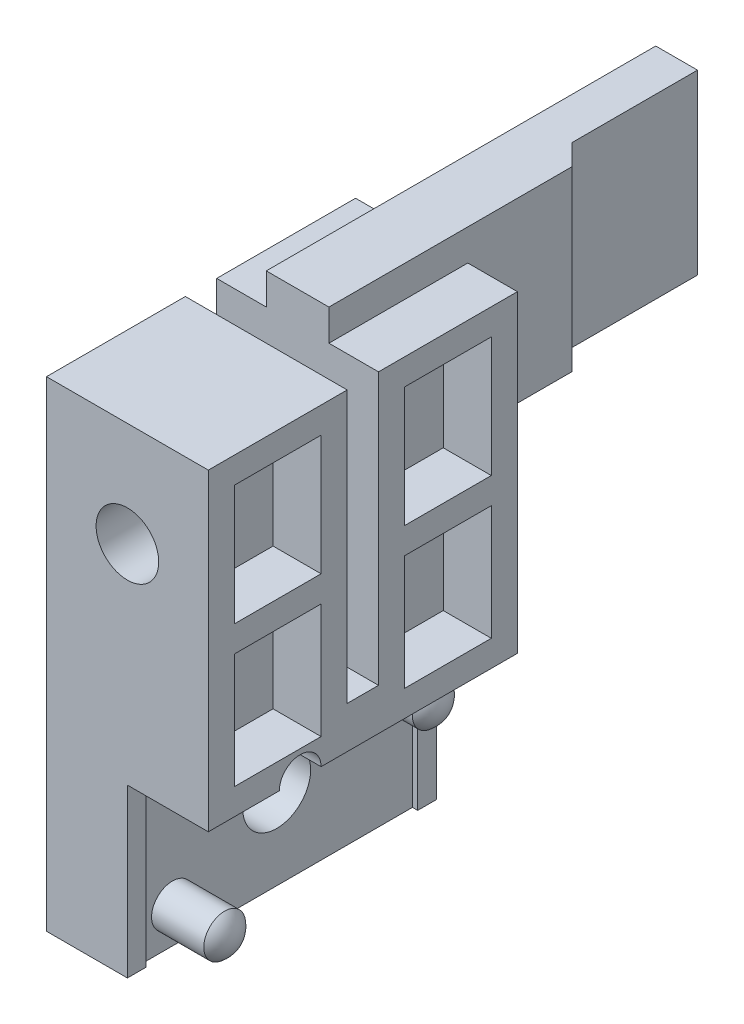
ISO-10303-21;
HEADER;
FILE_DESCRIPTION(('STEP AP214'),'2;1');
FILE_NAME('part.step','',(''),(''),'','','');
FILE_SCHEMA(('AUTOMOTIVE_DESIGN { 1 0 10303 214 1 1 1 1 }'));
ENDSEC;
DATA;
#1=APPLICATION_CONTEXT('core data for automotive mechanical design processes');
#2=APPLICATION_PROTOCOL_DEFINITION('international standard','automotive_design',2000,#1);
#3=PRODUCT_CONTEXT('',#1,'mechanical');
#4=PRODUCT('Part','Part','',(#3));
#5=PRODUCT_RELATED_PRODUCT_CATEGORY('part','',(#4));
#6=PRODUCT_DEFINITION_FORMATION('','',#4);
#7=PRODUCT_DEFINITION_CONTEXT('part definition',#1,'design');
#8=PRODUCT_DEFINITION('design','',#6,#7);
#9=PRODUCT_DEFINITION_SHAPE('','',#8);
#10=(LENGTH_UNIT() NAMED_UNIT(*) SI_UNIT(.MILLI.,.METRE.));
#11=(NAMED_UNIT(*) PLANE_ANGLE_UNIT() SI_UNIT($,.RADIAN.));
#12=(NAMED_UNIT(*) SI_UNIT($,.STERADIAN.) SOLID_ANGLE_UNIT());
#13=UNCERTAINTY_MEASURE_WITH_UNIT(LENGTH_MEASURE(1.E-05),#10,'distance_accuracy_value','');
#14=(GEOMETRIC_REPRESENTATION_CONTEXT(3) GLOBAL_UNCERTAINTY_ASSIGNED_CONTEXT((#13)) GLOBAL_UNIT_ASSIGNED_CONTEXT((#10,
#11,#12)) REPRESENTATION_CONTEXT('',''));
#15=CARTESIAN_POINT('',(0.,0.,0.));
#16=DIRECTION('',(0.,0.,1.));
#17=DIRECTION('',(1.,0.,0.));
#18=AXIS2_PLACEMENT_3D('',#15,#16,#17);
#19=CARTESIAN_POINT('',(-3.875,-14.,0.));
#20=DIRECTION('',(1.,0.,0.));
#21=DIRECTION('',(0.,1.,0.));
#22=AXIS2_PLACEMENT_3D('',#19,#20,#21);
#23=CYLINDRICAL_SURFACE('',#22,1.625);
#24=CARTESIAN_POINT('',(-0.249999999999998,-14.,0.));
#25=DIRECTION('',(1.,0.,0.));
#26=DIRECTION('',(0.,1.,0.));
#27=AXIS2_PLACEMENT_3D('',#24,#25,#26);
#28=CIRCLE('',#27,1.625);
#29=CARTESIAN_POINT('',(-0.249999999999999,-12.375,0.));
#30=VERTEX_POINT('',#29);
#31=EDGE_CURVE('E1103',#30,#30,#28,.T.);
#32=ORIENTED_EDGE('',*,*,#31,.T.);
#33=EDGE_LOOP('',(#32));
#34=FACE_BOUND('',#33,.T.);
#35=CARTESIAN_POINT('',(-1.87499999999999,-14.,0.));
#36=DIRECTION('',(-1.,0.,0.));
#37=DIRECTION('',(0.,-1.,0.));
#38=AXIS2_PLACEMENT_3D('',#35,#36,#37);
#39=CIRCLE('',#38,1.625);
#40=CARTESIAN_POINT('',(-1.87499999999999,-15.625,0.));
#41=VERTEX_POINT('',#40);
#42=EDGE_CURVE('E34',#41,#41,#39,.F.);
#43=ORIENTED_EDGE('',*,*,#42,.F.);
#44=EDGE_LOOP('',(#43));
#45=FACE_BOUND('',#44,.T.);
#46=ADVANCED_FACE('F30',(#34,#45),#23,.F.);
#47=CARTESIAN_POINT('',(3.87500000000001,-10.,7.4));
#48=DIRECTION('',(0.,1.,0.));
#49=DIRECTION('',(-1.,0.,0.));
#50=AXIS2_PLACEMENT_3D('',#47,#48,#49);
#51=PLANE('',#50);
#52=DIRECTION('',(0.,0.,1.));
#53=VECTOR('',#52,1.);
#54=CARTESIAN_POINT('',(-0.249999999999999,-10.,6.5));
#55=LINE('',#54,#53);
#56=CARTESIAN_POINT('',(-0.249999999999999,-10.,4.));
#57=VERTEX_POINT('',#56);
#58=CARTESIAN_POINT('',(-0.249999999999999,-10.,6.5));
#59=VERTEX_POINT('',#58);
#60=EDGE_CURVE('E403',#57,#59,#55,.T.);
#61=ORIENTED_EDGE('',*,*,#60,.F.);
#62=DIRECTION('',(1.,0.,0.));
#63=VECTOR('',#62,1.);
#64=CARTESIAN_POINT('',(-3.07842712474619,-10.,4.));
#65=LINE('',#64,#63);
#66=CARTESIAN_POINT('',(3.87500000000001,-10.,4.));
#67=VERTEX_POINT('',#66);
#68=EDGE_CURVE('E384',#57,#67,#65,.T.);
#69=ORIENTED_EDGE('',*,*,#68,.T.);
#70=DIRECTION('',(0.,0.,-1.));
#71=VECTOR('',#70,1.);
#72=CARTESIAN_POINT('',(3.87500000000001,-10.,7.4));
#73=LINE('',#72,#71);
#74=CARTESIAN_POINT('',(3.87500000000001,-10.,7.4));
#75=VERTEX_POINT('',#74);
#76=EDGE_CURVE('E808',#75,#67,#73,.T.);
#77=ORIENTED_EDGE('',*,*,#76,.F.);
#78=DIRECTION('',(1.,0.,0.));
#79=VECTOR('',#78,1.);
#80=CARTESIAN_POINT('',(3.87500000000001,-10.,7.4));
#81=LINE('',#80,#79);
#82=CARTESIAN_POINT('',(0.,-10.,7.4));
#83=VERTEX_POINT('',#82);
#84=EDGE_CURVE('E794',#83,#75,#81,.T.);
#85=ORIENTED_EDGE('',*,*,#84,.F.);
#86=DIRECTION('',(0.,0.,-1.));
#87=VECTOR('',#86,1.);
#88=CARTESIAN_POINT('',(0.,-10.,7.4));
#89=LINE('',#88,#87);
#90=CARTESIAN_POINT('',(0.,-10.,6.5));
#91=VERTEX_POINT('',#90);
#92=EDGE_CURVE('E812',#83,#91,#89,.T.);
#93=ORIENTED_EDGE('',*,*,#92,.T.);
#94=DIRECTION('',(1.,0.,0.));
#95=VECTOR('',#94,1.);
#96=CARTESIAN_POINT('',(-0.249999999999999,-10.,6.5));
#97=LINE('',#96,#95);
#98=EDGE_CURVE('E415',#59,#91,#97,.T.);
#99=ORIENTED_EDGE('',*,*,#98,.F.);
#100=EDGE_LOOP('',(#61,#69,#77,#85,#93,#99));
#101=FACE_BOUND('',#100,.T.);
#102=ADVANCED_FACE('F845',(#101),#51,.F.);
#103=CARTESIAN_POINT('',(-0.249999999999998,-18.,-6.5));
#104=DIRECTION('',(1.,0.,0.));
#105=DIRECTION('',(0.,1.,0.));
#106=AXIS2_PLACEMENT_3D('',#103,#104,#105);
#107=PLANE('',#106);
#108=CARTESIAN_POINT('',(-0.249999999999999,-10.,-6.5));
#109=VERTEX_POINT('',#108);
#110=CARTESIAN_POINT('',(-0.249999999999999,-10.,2.));
#111=VERTEX_POINT('',#110);
#112=EDGE_CURVE('E393',#109,#111,#55,.T.);
#113=ORIENTED_EDGE('',*,*,#112,.T.);
#114=CARTESIAN_POINT('',(-0.249999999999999,-10.,3.));
#115=DIRECTION('',(1.,0.,0.));
#116=DIRECTION('',(0.,1.,0.));
#117=AXIS2_PLACEMENT_3D('',#114,#115,#116);
#118=CIRCLE('',#117,1.);
#119=EDGE_CURVE('E381',#57,#111,#118,.F.);
#120=ORIENTED_EDGE('',*,*,#119,.F.);
#121=ORIENTED_EDGE('',*,*,#60,.T.);
#122=DIRECTION('',(0.,-1.,0.));
#123=VECTOR('',#122,1.);
#124=CARTESIAN_POINT('',(-0.249999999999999,-10.,6.5));
#125=LINE('',#124,#123);
#126=CARTESIAN_POINT('',(-0.249999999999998,-18.,6.5));
#127=VERTEX_POINT('',#126);
#128=EDGE_CURVE('E402',#59,#127,#125,.T.);
#129=ORIENTED_EDGE('',*,*,#128,.T.);
#130=DIRECTION('',(0.,0.,-1.));
#131=VECTOR('',#130,1.);
#132=CARTESIAN_POINT('',(-0.249999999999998,-18.,-6.5));
#133=LINE('',#132,#131);
#134=CARTESIAN_POINT('',(-0.249999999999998,-18.,-6.5));
#135=VERTEX_POINT('',#134);
#136=EDGE_CURVE('E1107',#127,#135,#133,.T.);
#137=ORIENTED_EDGE('',*,*,#136,.T.);
#138=DIRECTION('',(0.,1.,0.));
#139=VECTOR('',#138,1.);
#140=CARTESIAN_POINT('',(-0.249999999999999,-10.,-6.5));
#141=LINE('',#140,#139);
#142=EDGE_CURVE('E401',#135,#109,#141,.T.);
#143=ORIENTED_EDGE('',*,*,#142,.T.);
#144=EDGE_LOOP('',(#113,#120,#121,#129,#137,#143));
#145=FACE_BOUND('',#144,.T.);
#146=CARTESIAN_POINT('',(-0.249999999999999,-11.6951800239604,-4.99377661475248));
#147=DIRECTION('',(1.,0.,0.));
#148=DIRECTION('',(0.,1.,0.));
#149=AXIS2_PLACEMENT_3D('',#146,#147,#148);
#150=CIRCLE('',#149,1.);
#151=CARTESIAN_POINT('',(-0.249999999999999,-10.6951800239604,-4.99377661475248));
#152=VERTEX_POINT('',#151);
#153=EDGE_CURVE('E1097',#152,#152,#150,.T.);
#154=ORIENTED_EDGE('',*,*,#153,.F.);
#155=EDGE_LOOP('',(#154));
#156=FACE_BOUND('',#155,.T.);
#157=ORIENTED_EDGE('',*,*,#31,.F.);
#158=EDGE_LOOP('',(#157));
#159=FACE_BOUND('',#158,.T.);
#160=CARTESIAN_POINT('',(-0.249999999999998,-16.3048199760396,4.99377661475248));
#161=DIRECTION('',(1.,0.,0.));
#162=DIRECTION('',(0.,-1.,0.));
#163=AXIS2_PLACEMENT_3D('',#160,#161,#162);
#164=CIRCLE('',#163,0.999999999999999);
#165=CARTESIAN_POINT('',(-0.249999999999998,-17.3048199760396,4.99377661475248));
#166=VERTEX_POINT('',#165);
#167=EDGE_CURVE('E1089',#166,#166,#164,.T.);
#168=ORIENTED_EDGE('',*,*,#167,.F.);
#169=EDGE_LOOP('',(#168));
#170=FACE_BOUND('',#169,.T.);
#171=ADVANCED_FACE('F398',(#145,#156,#159,#170),#107,.T.);
#172=CARTESIAN_POINT('',(0.,-10.,7.4));
#173=DIRECTION('',(-1.,0.,0.));
#174=DIRECTION('',(0.,-1.,0.));
#175=AXIS2_PLACEMENT_3D('',#172,#173,#174);
#176=PLANE('',#175);
#177=DIRECTION('',(0.,0.,-1.));
#178=VECTOR('',#177,1.);
#179=CARTESIAN_POINT('',(0.,-18.,7.4));
#180=LINE('',#179,#178);
#181=CARTESIAN_POINT('',(0.,-18.,7.4));
#182=VERTEX_POINT('',#181);
#183=CARTESIAN_POINT('',(0.,-18.,6.5));
#184=VERTEX_POINT('',#183);
#185=EDGE_CURVE('E816',#182,#184,#180,.T.);
#186=ORIENTED_EDGE('',*,*,#185,.T.);
#187=DIRECTION('',(0.,-1.,0.));
#188=VECTOR('',#187,1.);
#189=CARTESIAN_POINT('',(0.,-10.,6.5));
#190=LINE('',#189,#188);
#191=EDGE_CURVE('E1106',#91,#184,#190,.T.);
#192=ORIENTED_EDGE('',*,*,#191,.F.);
#193=ORIENTED_EDGE('',*,*,#92,.F.);
#194=DIRECTION('',(0.,1.,0.));
#195=VECTOR('',#194,1.);
#196=CARTESIAN_POINT('',(0.,-10.,7.4));
#197=LINE('',#196,#195);
#198=EDGE_CURVE('E792',#182,#83,#197,.T.);
#199=ORIENTED_EDGE('',*,*,#198,.F.);
#200=EDGE_LOOP('',(#186,#192,#193,#199));
#201=FACE_BOUND('',#200,.T.);
#202=ADVANCED_FACE('F861',(#201),#176,.F.);
#203=CARTESIAN_POINT('',(-3.87499999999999,5.,7.4));
#204=DIRECTION('',(0.,0.,-1.));
#205=DIRECTION('',(-1.,0.,0.));
#206=AXIS2_PLACEMENT_3D('',#203,#204,#205);
#207=PLANE('',#206);
#208=DIRECTION('',(0.,-1.,0.));
#209=VECTOR('',#208,1.);
#210=CARTESIAN_POINT('',(-3.87499999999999,-18.,7.4));
#211=LINE('',#210,#209);
#212=CARTESIAN_POINT('',(-3.87499999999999,5.,7.4));
#213=VERTEX_POINT('',#212);
#214=CARTESIAN_POINT('',(-3.87499999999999,-18.,7.4));
#215=VERTEX_POINT('',#214);
#216=EDGE_CURVE('E787',#213,#215,#211,.T.);
#217=ORIENTED_EDGE('',*,*,#216,.T.);
#218=DIRECTION('',(1.,0.,0.));
#219=VECTOR('',#218,1.);
#220=CARTESIAN_POINT('',(0.,-18.,7.4));
#221=LINE('',#220,#219);
#222=EDGE_CURVE('E790',#215,#182,#221,.T.);
#223=ORIENTED_EDGE('',*,*,#222,.T.);
#224=ORIENTED_EDGE('',*,*,#198,.T.);
#225=ORIENTED_EDGE('',*,*,#84,.T.);
#226=DIRECTION('',(0.,1.,0.));
#227=VECTOR('',#226,1.);
#228=CARTESIAN_POINT('',(3.87500000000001,5.,7.4));
#229=LINE('',#228,#227);
#230=CARTESIAN_POINT('',(3.87500000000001,5.,7.4));
#231=VERTEX_POINT('',#230);
#232=EDGE_CURVE('E796',#75,#231,#229,.T.);
#233=ORIENTED_EDGE('',*,*,#232,.T.);
#234=DIRECTION('',(-1.,0.,0.));
#235=VECTOR('',#234,1.);
#236=CARTESIAN_POINT('',(-3.87499999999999,5.,7.4));
#237=LINE('',#236,#235);
#238=EDGE_CURVE('E798',#231,#213,#237,.T.);
#239=ORIENTED_EDGE('',*,*,#238,.T.);
#240=EDGE_LOOP('',(#217,#223,#224,#225,#233,#239));
#241=FACE_BOUND('',#240,.T.);
#242=CARTESIAN_POINT('',(0.,0.,7.4));
#243=DIRECTION('',(0.,0.,-1.));
#244=DIRECTION('',(-1.,0.,0.));
#245=AXIS2_PLACEMENT_3D('',#242,#243,#244);
#246=CIRCLE('',#245,1.5);
#247=CARTESIAN_POINT('',(-1.5,0.,7.4));
#248=VERTEX_POINT('',#247);
#249=EDGE_CURVE('E414',#248,#248,#246,.T.);
#250=ORIENTED_EDGE('',*,*,#249,.T.);
#251=EDGE_LOOP('',(#250));
#252=FACE_BOUND('',#251,.T.);
#253=ADVANCED_FACE('F839',(#241,#252),#207,.F.);
#254=CARTESIAN_POINT('',(-3.875,5.,0.75));
#255=DIRECTION('',(0.,0.,1.));
#256=DIRECTION('',(0.,-1.,0.));
#257=AXIS2_PLACEMENT_3D('',#254,#255,#256);
#258=PLANE('',#257);
#259=DIRECTION('',(0.,-1.,0.));
#260=VECTOR('',#259,1.);
#261=CARTESIAN_POINT('',(3.87500000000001,5.,0.75));
#262=LINE('',#261,#260);
#263=CARTESIAN_POINT('',(3.87500000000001,5.,0.75));
#264=VERTEX_POINT('',#263);
#265=CARTESIAN_POINT('',(3.87500000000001,-8.,0.749999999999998));
#266=VERTEX_POINT('',#265);
#267=EDGE_CURVE('E748',#264,#266,#262,.T.);
#268=ORIENTED_EDGE('',*,*,#267,.T.);
#269=DIRECTION('',(1.,0.,0.));
#270=VECTOR('',#269,1.);
#271=CARTESIAN_POINT('',(-3.87499999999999,-8.,0.749999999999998));
#272=LINE('',#271,#270);
#273=CARTESIAN_POINT('',(-3.87499999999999,-8.,0.749999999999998));
#274=VERTEX_POINT('',#273);
#275=EDGE_CURVE('E761',#274,#266,#272,.T.);
#276=ORIENTED_EDGE('',*,*,#275,.F.);
#277=DIRECTION('',(0.,-1.,0.));
#278=VECTOR('',#277,1.);
#279=CARTESIAN_POINT('',(-3.875,5.,0.75));
#280=LINE('',#279,#278);
#281=CARTESIAN_POINT('',(-3.875,5.,0.75));
#282=VERTEX_POINT('',#281);
#283=EDGE_CURVE('E757',#282,#274,#280,.T.);
#284=ORIENTED_EDGE('',*,*,#283,.F.);
#285=DIRECTION('',(1.,0.,0.));
#286=VECTOR('',#285,1.);
#287=CARTESIAN_POINT('',(-3.875,5.,0.75));
#288=LINE('',#287,#286);
#289=EDGE_CURVE('E764',#282,#264,#288,.T.);
#290=ORIENTED_EDGE('',*,*,#289,.T.);
#291=EDGE_LOOP('',(#268,#276,#284,#290));
#292=FACE_BOUND('',#291,.T.);
#293=CARTESIAN_POINT('',(0.,0.,0.750000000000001));
#294=DIRECTION('',(0.,0.,1.));
#295=DIRECTION('',(0.,-1.,0.));
#296=AXIS2_PLACEMENT_3D('',#293,#294,#295);
#297=CIRCLE('',#296,1.5);
#298=CARTESIAN_POINT('',(0.,-1.5,0.75));
#299=VERTEX_POINT('',#298);
#300=EDGE_CURVE('E426',#299,#299,#297,.F.);
#301=ORIENTED_EDGE('',*,*,#300,.F.);
#302=EDGE_LOOP('',(#301));
#303=FACE_BOUND('',#302,.T.);
#304=ADVANCED_FACE('F828',(#292,#303),#258,.F.);
#305=CARTESIAN_POINT('',(-3.875,5.,-0.75));
#306=DIRECTION('',(0.,0.,-1.));
#307=DIRECTION('',(0.,1.,0.));
#308=AXIS2_PLACEMENT_3D('',#305,#306,#307);
#309=PLANE('',#308);
#310=DIRECTION('',(1.,0.,0.));
#311=VECTOR('',#310,1.);
#312=CARTESIAN_POINT('',(-3.875,5.,-0.75));
#313=LINE('',#312,#311);
#314=CARTESIAN_POINT('',(1.5,5.,-0.75));
#315=VERTEX_POINT('',#314);
#316=CARTESIAN_POINT('',(3.87500000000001,5.,-0.750000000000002));
#317=VERTEX_POINT('',#316);
#318=EDGE_CURVE('E768',#315,#317,#313,.T.);
#319=ORIENTED_EDGE('',*,*,#318,.F.);
#320=DIRECTION('',(0.,1.,0.));
#321=VECTOR('',#320,1.);
#322=CARTESIAN_POINT('',(1.5,-20.8897458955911,-0.75));
#323=LINE('',#322,#321);
#324=CARTESIAN_POINT('',(1.5,6.5,-0.75));
#325=VERTEX_POINT('',#324);
#326=EDGE_CURVE('E454',#315,#325,#323,.T.);
#327=ORIENTED_EDGE('',*,*,#326,.T.);
#328=DIRECTION('',(1.,0.,0.));
#329=VECTOR('',#328,1.);
#330=CARTESIAN_POINT('',(1.5,6.5,-0.75));
#331=LINE('',#330,#329);
#332=CARTESIAN_POINT('',(-1.5,6.5,-0.75));
#333=VERTEX_POINT('',#332);
#334=EDGE_CURVE('E430',#333,#325,#331,.T.);
#335=ORIENTED_EDGE('',*,*,#334,.F.);
#336=DIRECTION('',(0.,1.,0.));
#337=VECTOR('',#336,1.);
#338=CARTESIAN_POINT('',(-1.5,-20.8897458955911,-0.75));
#339=LINE('',#338,#337);
#340=CARTESIAN_POINT('',(-1.5,5.,-0.75));
#341=VERTEX_POINT('',#340);
#342=EDGE_CURVE('E458',#341,#333,#339,.T.);
#343=ORIENTED_EDGE('',*,*,#342,.F.);
#344=CARTESIAN_POINT('',(-3.875,5.,-0.75));
#345=VERTEX_POINT('',#344);
#346=EDGE_CURVE('E766',#345,#341,#313,.T.);
#347=ORIENTED_EDGE('',*,*,#346,.F.);
#348=DIRECTION('',(0.,1.,0.));
#349=VECTOR('',#348,1.);
#350=CARTESIAN_POINT('',(-3.875,5.,-0.75));
#351=LINE('',#350,#349);
#352=CARTESIAN_POINT('',(-3.87499999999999,-8.,-0.750000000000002));
#353=VERTEX_POINT('',#352);
#354=EDGE_CURVE('E754',#353,#345,#351,.T.);
#355=ORIENTED_EDGE('',*,*,#354,.F.);
#356=DIRECTION('',(1.,0.,0.));
#357=VECTOR('',#356,1.);
#358=CARTESIAN_POINT('',(-3.87499999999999,-8.,-0.750000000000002));
#359=LINE('',#358,#357);
#360=CARTESIAN_POINT('',(3.87500000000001,-8.,-0.750000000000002));
#361=VERTEX_POINT('',#360);
#362=EDGE_CURVE('E760',#353,#361,#359,.T.);
#363=ORIENTED_EDGE('',*,*,#362,.T.);
#364=DIRECTION('',(0.,1.,0.));
#365=VECTOR('',#364,1.);
#366=CARTESIAN_POINT('',(3.87500000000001,5.,-0.75));
#367=LINE('',#366,#365);
#368=EDGE_CURVE('E745',#361,#317,#367,.T.);
#369=ORIENTED_EDGE('',*,*,#368,.T.);
#370=EDGE_LOOP('',(#319,#327,#335,#343,#347,#355,#363,#369));
#371=FACE_BOUND('',#370,.T.);
#372=CARTESIAN_POINT('',(0.,0.,-0.750000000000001));
#373=DIRECTION('',(0.,0.,-1.));
#374=DIRECTION('',(0.,1.,0.));
#375=AXIS2_PLACEMENT_3D('',#372,#373,#374);
#376=CIRCLE('',#375,1.5);
#377=CARTESIAN_POINT('',(0.,1.5,-0.75));
#378=VERTEX_POINT('',#377);
#379=EDGE_CURVE('E425',#378,#378,#376,.F.);
#380=ORIENTED_EDGE('',*,*,#379,.F.);
#381=EDGE_LOOP('',(#380));
#382=FACE_BOUND('',#381,.T.);
#383=ADVANCED_FACE('F825',(#371,#382),#309,.F.);
#384=CARTESIAN_POINT('',(-3.87499999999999,5.,7.4));
#385=DIRECTION('',(0.,-1.,0.));
#386=DIRECTION('',(1.,0.,0.));
#387=AXIS2_PLACEMENT_3D('',#384,#385,#386);
#388=PLANE('',#387);
#389=ORIENTED_EDGE('',*,*,#346,.T.);
#390=DIRECTION('',(0.,0.,-1.));
#391=VECTOR('',#390,1.);
#392=CARTESIAN_POINT('',(-1.5,5.,7.4));
#393=LINE('',#392,#391);
#394=CARTESIAN_POINT('',(-1.5,5.,-7.4));
#395=VERTEX_POINT('',#394);
#396=EDGE_CURVE('E481',#341,#395,#393,.T.);
#397=ORIENTED_EDGE('',*,*,#396,.T.);
#398=DIRECTION('',(-1.,0.,0.));
#399=VECTOR('',#398,1.);
#400=CARTESIAN_POINT('',(-3.87499999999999,5.,-7.4));
#401=LINE('',#400,#399);
#402=CARTESIAN_POINT('',(-3.87499999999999,5.,-7.4));
#403=VERTEX_POINT('',#402);
#404=EDGE_CURVE('E783',#395,#403,#401,.T.);
#405=ORIENTED_EDGE('',*,*,#404,.T.);
#406=DIRECTION('',(0.,0.,-1.));
#407=VECTOR('',#406,1.);
#408=CARTESIAN_POINT('',(-3.87499999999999,5.,7.4));
#409=LINE('',#408,#407);
#410=EDGE_CURVE('E800',#345,#403,#409,.T.);
#411=ORIENTED_EDGE('',*,*,#410,.F.);
#412=EDGE_LOOP('',(#389,#397,#405,#411));
#413=FACE_BOUND('',#412,.T.);
#414=ADVANCED_FACE('F827',(#413),#388,.F.);
#415=DIRECTION('',(0.,0.,-1.));
#416=VECTOR('',#415,1.);
#417=CARTESIAN_POINT('',(3.87500000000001,5.,7.4));
#418=LINE('',#417,#416);
#419=EDGE_CURVE('E805',#231,#264,#418,.T.);
#420=ORIENTED_EDGE('',*,*,#419,.T.);
#421=ORIENTED_EDGE('',*,*,#289,.F.);
#422=EDGE_CURVE('E801',#213,#282,#409,.T.);
#423=ORIENTED_EDGE('',*,*,#422,.F.);
#424=ORIENTED_EDGE('',*,*,#238,.F.);
#425=EDGE_LOOP('',(#420,#421,#423,#424));
#426=FACE_BOUND('',#425,.T.);
#427=ADVANCED_FACE('F835',(#426),#388,.F.);
#428=CARTESIAN_POINT('',(-3.87499999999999,-18.,7.4));
#429=DIRECTION('',(1.,0.,0.));
#430=DIRECTION('',(0.,1.,0.));
#431=AXIS2_PLACEMENT_3D('',#428,#429,#430);
#432=PLANE('',#431);
#433=CARTESIAN_POINT('',(-3.87499999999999,-14.,0.));
#434=DIRECTION('',(-1.,0.,0.));
#435=DIRECTION('',(0.,-1.,0.));
#436=AXIS2_PLACEMENT_3D('',#433,#434,#435);
#437=CIRCLE('',#436,2.375);
#438=CARTESIAN_POINT('',(-3.87499999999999,-16.375,0.));
#439=VERTEX_POINT('',#438);
#440=EDGE_CURVE('E1213',#439,#439,#437,.T.);
#441=ORIENTED_EDGE('',*,*,#440,.F.);
#442=EDGE_LOOP('',(#441));
#443=FACE_BOUND('',#442,.T.);
#444=DIRECTION('',(0.,0.,1.));
#445=VECTOR('',#444,1.);
#446=CARTESIAN_POINT('',(-3.87499999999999,-12.,-6.15));
#447=LINE('',#446,#445);
#448=CARTESIAN_POINT('',(-3.87499999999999,-12.,-6.15));
#449=VERTEX_POINT('',#448);
#450=CARTESIAN_POINT('',(-3.87499999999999,-12.,-1.99999999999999));
#451=VERTEX_POINT('',#450);
#452=EDGE_CURVE('E488',#449,#451,#447,.T.);
#453=ORIENTED_EDGE('',*,*,#452,.F.);
#454=DIRECTION('',(0.,-1.,0.));
#455=VECTOR('',#454,1.);
#456=CARTESIAN_POINT('',(-3.87499999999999,-3.25,-6.15));
#457=LINE('',#456,#455);
#458=CARTESIAN_POINT('',(-3.87499999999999,-3.25,-6.15));
#459=VERTEX_POINT('',#458);
#460=EDGE_CURVE('E486',#459,#449,#457,.T.);
#461=ORIENTED_EDGE('',*,*,#460,.F.);
#462=DIRECTION('',(0.,0.,-1.));
#463=VECTOR('',#462,1.);
#464=CARTESIAN_POINT('',(-3.87499999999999,-3.25,-6.15));
#465=LINE('',#464,#463);
#466=CARTESIAN_POINT('',(-3.87499999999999,-3.25,-2.));
#467=VERTEX_POINT('',#466);
#468=EDGE_CURVE('E494',#467,#459,#465,.T.);
#469=ORIENTED_EDGE('',*,*,#468,.F.);
#470=DIRECTION('',(0.,1.,0.));
#471=VECTOR('',#470,1.);
#472=CARTESIAN_POINT('',(-3.87499999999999,-12.,-1.99999999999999));
#473=LINE('',#472,#471);
#474=EDGE_CURVE('E491',#451,#467,#473,.T.);
#475=ORIENTED_EDGE('',*,*,#474,.F.);
#476=EDGE_LOOP('',(#453,#461,#469,#475));
#477=FACE_BOUND('',#476,.T.);
#478=DIRECTION('',(0.,-1.,0.));
#479=VECTOR('',#478,1.);
#480=CARTESIAN_POINT('',(-3.87499999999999,3.75,-6.15));
#481=LINE('',#480,#479);
#482=CARTESIAN_POINT('',(-3.87499999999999,3.75,-6.15));
#483=VERTEX_POINT('',#482);
#484=CARTESIAN_POINT('',(-3.87499999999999,-2.,-6.15));
#485=VERTEX_POINT('',#484);
#486=EDGE_CURVE('E520',#483,#485,#481,.T.);
#487=ORIENTED_EDGE('',*,*,#486,.F.);
#488=DIRECTION('',(0.,0.,-1.));
#489=VECTOR('',#488,1.);
#490=CARTESIAN_POINT('',(-3.87499999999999,3.75,-2.));
#491=LINE('',#490,#489);
#492=CARTESIAN_POINT('',(-3.87499999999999,3.75,-2.));
#493=VERTEX_POINT('',#492);
#494=EDGE_CURVE('E512',#493,#483,#491,.T.);
#495=ORIENTED_EDGE('',*,*,#494,.F.);
#496=DIRECTION('',(0.,1.,0.));
#497=VECTOR('',#496,1.);
#498=CARTESIAN_POINT('',(-3.87499999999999,-2.,-2.));
#499=LINE('',#498,#497);
#500=CARTESIAN_POINT('',(-3.87499999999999,-2.,-2.));
#501=VERTEX_POINT('',#500);
#502=EDGE_CURVE('E526',#501,#493,#499,.T.);
#503=ORIENTED_EDGE('',*,*,#502,.F.);
#504=DIRECTION('',(0.,0.,1.));
#505=VECTOR('',#504,1.);
#506=CARTESIAN_POINT('',(-3.87499999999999,-2.,-2.));
#507=LINE('',#506,#505);
#508=EDGE_CURVE('E523',#485,#501,#507,.T.);
#509=ORIENTED_EDGE('',*,*,#508,.F.);
#510=EDGE_LOOP('',(#487,#495,#503,#509));
#511=FACE_BOUND('',#510,.T.);
#512=DIRECTION('',(0.,0.,1.));
#513=VECTOR('',#512,1.);
#514=CARTESIAN_POINT('',(-3.87499999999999,-2.,6.15));
#515=LINE('',#514,#513);
#516=CARTESIAN_POINT('',(-3.87499999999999,-2.,2.));
#517=VERTEX_POINT('',#516);
#518=CARTESIAN_POINT('',(-3.87499999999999,-2.,6.15));
#519=VERTEX_POINT('',#518);
#520=EDGE_CURVE('E552',#517,#519,#515,.T.);
#521=ORIENTED_EDGE('',*,*,#520,.F.);
#522=DIRECTION('',(0.,-1.,0.));
#523=VECTOR('',#522,1.);
#524=CARTESIAN_POINT('',(-3.87499999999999,-2.,2.));
#525=LINE('',#524,#523);
#526=CARTESIAN_POINT('',(-3.87499999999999,3.75,2.));
#527=VERTEX_POINT('',#526);
#528=EDGE_CURVE('E544',#527,#517,#525,.T.);
#529=ORIENTED_EDGE('',*,*,#528,.F.);
#530=DIRECTION('',(0.,0.,-1.));
#531=VECTOR('',#530,1.);
#532=CARTESIAN_POINT('',(-3.87499999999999,3.75,2.));
#533=LINE('',#532,#531);
#534=CARTESIAN_POINT('',(-3.87499999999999,3.75,6.15));
#535=VERTEX_POINT('',#534);
#536=EDGE_CURVE('E558',#535,#527,#533,.T.);
#537=ORIENTED_EDGE('',*,*,#536,.F.);
#538=DIRECTION('',(0.,1.,0.));
#539=VECTOR('',#538,1.);
#540=CARTESIAN_POINT('',(-3.87499999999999,3.75,6.15));
#541=LINE('',#540,#539);
#542=EDGE_CURVE('E555',#519,#535,#541,.T.);
#543=ORIENTED_EDGE('',*,*,#542,.F.);
#544=EDGE_LOOP('',(#521,#529,#537,#543));
#545=FACE_BOUND('',#544,.T.);
#546=DIRECTION('',(0.,0.,-1.));
#547=VECTOR('',#546,1.);
#548=CARTESIAN_POINT('',(-3.87499999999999,-3.25,2.));
#549=LINE('',#548,#547);
#550=CARTESIAN_POINT('',(-3.87499999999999,-3.25,6.15));
#551=VERTEX_POINT('',#550);
#552=CARTESIAN_POINT('',(-3.87499999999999,-3.25,2.));
#553=VERTEX_POINT('',#552);
#554=EDGE_CURVE('E584',#551,#553,#549,.T.);
#555=ORIENTED_EDGE('',*,*,#554,.F.);
#556=DIRECTION('',(0.,1.,0.));
#557=VECTOR('',#556,1.);
#558=CARTESIAN_POINT('',(-3.87499999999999,-3.25,6.15));
#559=LINE('',#558,#557);
#560=CARTESIAN_POINT('',(-3.87499999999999,-12.,6.15));
#561=VERTEX_POINT('',#560);
#562=EDGE_CURVE('E576',#561,#551,#559,.T.);
#563=ORIENTED_EDGE('',*,*,#562,.F.);
#564=DIRECTION('',(0.,0.,1.));
#565=VECTOR('',#564,1.);
#566=CARTESIAN_POINT('',(-3.87499999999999,-12.,6.15));
#567=LINE('',#566,#565);
#568=CARTESIAN_POINT('',(-3.87499999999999,-12.,2.));
#569=VERTEX_POINT('',#568);
#570=EDGE_CURVE('E590',#569,#561,#567,.T.);
#571=ORIENTED_EDGE('',*,*,#570,.F.);
#572=DIRECTION('',(0.,-1.,0.));
#573=VECTOR('',#572,1.);
#574=CARTESIAN_POINT('',(-3.87499999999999,-12.,2.));
#575=LINE('',#574,#573);
#576=EDGE_CURVE('E587',#553,#569,#575,.T.);
#577=ORIENTED_EDGE('',*,*,#576,.F.);
#578=EDGE_LOOP('',(#555,#563,#571,#577));
#579=FACE_BOUND('',#578,.T.);
#580=ORIENTED_EDGE('',*,*,#422,.T.);
#581=ORIENTED_EDGE('',*,*,#283,.T.);
#582=DIRECTION('',(0.,0.,-1.));
#583=VECTOR('',#582,1.);
#584=CARTESIAN_POINT('',(-3.87499999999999,-8.,0.749999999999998));
#585=LINE('',#584,#583);
#586=EDGE_CURVE('E751',#274,#353,#585,.T.);
#587=ORIENTED_EDGE('',*,*,#586,.T.);
#588=ORIENTED_EDGE('',*,*,#354,.T.);
#589=ORIENTED_EDGE('',*,*,#410,.T.);
#590=DIRECTION('',(0.,-1.,0.));
#591=VECTOR('',#590,1.);
#592=CARTESIAN_POINT('',(-3.87499999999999,-18.,-7.4));
#593=LINE('',#592,#591);
#594=CARTESIAN_POINT('',(-3.87499999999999,-18.,-7.4));
#595=VERTEX_POINT('',#594);
#596=EDGE_CURVE('E763',#403,#595,#593,.T.);
#597=ORIENTED_EDGE('',*,*,#596,.T.);
#598=DIRECTION('',(0.,0.,-1.));
#599=VECTOR('',#598,1.);
#600=CARTESIAN_POINT('',(-3.87499999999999,-18.,7.4));
#601=LINE('',#600,#599);
#602=EDGE_CURVE('E39',#215,#595,#601,.T.);
#603=ORIENTED_EDGE('',*,*,#602,.F.);
#604=ORIENTED_EDGE('',*,*,#216,.F.);
#605=EDGE_LOOP('',(#580,#581,#587,#588,#589,#597,#603,#604));
#606=FACE_BOUND('',#605,.T.);
#607=ADVANCED_FACE('F1149',(#443,#477,#511,#545,#579,#606),#432,.F.);
#608=CARTESIAN_POINT('',(0.,-18.,7.4));
#609=DIRECTION('',(0.,1.,0.));
#610=DIRECTION('',(-1.,0.,0.));
#611=AXIS2_PLACEMENT_3D('',#608,#609,#610);
#612=PLANE('',#611);
#613=ORIENTED_EDGE('',*,*,#136,.F.);
#614=DIRECTION('',(1.,0.,0.));
#615=VECTOR('',#614,1.);
#616=CARTESIAN_POINT('',(-0.249999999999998,-18.,6.5));
#617=LINE('',#616,#615);
#618=EDGE_CURVE('E411',#127,#184,#617,.T.);
#619=ORIENTED_EDGE('',*,*,#618,.T.);
#620=ORIENTED_EDGE('',*,*,#185,.F.);
#621=ORIENTED_EDGE('',*,*,#222,.F.);
#622=ORIENTED_EDGE('',*,*,#602,.T.);
#623=DIRECTION('',(1.,0.,0.));
#624=VECTOR('',#623,1.);
#625=CARTESIAN_POINT('',(0.,-18.,-7.4));
#626=LINE('',#625,#624);
#627=CARTESIAN_POINT('',(0.,-18.,-7.4));
#628=VERTEX_POINT('',#627);
#629=EDGE_CURVE('E772',#595,#628,#626,.T.);
#630=ORIENTED_EDGE('',*,*,#629,.T.);
#631=CARTESIAN_POINT('',(0.,-18.,-6.5));
#632=VERTEX_POINT('',#631);
#633=EDGE_CURVE('E815',#632,#628,#180,.T.);
#634=ORIENTED_EDGE('',*,*,#633,.F.);
#635=DIRECTION('',(1.,0.,0.));
#636=VECTOR('',#635,1.);
#637=CARTESIAN_POINT('',(-0.249999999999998,-18.,-6.5));
#638=LINE('',#637,#636);
#639=EDGE_CURVE('E406',#135,#632,#638,.T.);
#640=ORIENTED_EDGE('',*,*,#639,.F.);
#641=EDGE_LOOP('',(#613,#619,#620,#621,#622,#630,#634,#640));
#642=FACE_BOUND('',#641,.T.);
#643=ADVANCED_FACE('F1113',(#642),#612,.F.);
#644=CARTESIAN_POINT('',(0.,-10.,-6.5));
#645=VERTEX_POINT('',#644);
#646=CARTESIAN_POINT('',(0.,-10.,-7.4));
#647=VERTEX_POINT('',#646);
#648=EDGE_CURVE('E811',#645,#647,#89,.T.);
#649=ORIENTED_EDGE('',*,*,#648,.F.);
#650=DIRECTION('',(0.,1.,0.));
#651=VECTOR('',#650,1.);
#652=CARTESIAN_POINT('',(0.,-10.,-6.5));
#653=LINE('',#652,#651);
#654=EDGE_CURVE('E53',#632,#645,#653,.T.);
#655=ORIENTED_EDGE('',*,*,#654,.F.);
#656=ORIENTED_EDGE('',*,*,#633,.T.);
#657=DIRECTION('',(0.,1.,0.));
#658=VECTOR('',#657,1.);
#659=CARTESIAN_POINT('',(0.,-10.,-7.4));
#660=LINE('',#659,#658);
#661=EDGE_CURVE('E775',#628,#647,#660,.T.);
#662=ORIENTED_EDGE('',*,*,#661,.T.);
#663=EDGE_LOOP('',(#649,#655,#656,#662));
#664=FACE_BOUND('',#663,.T.);
#665=ADVANCED_FACE('F1116',(#664),#176,.F.);
#666=CARTESIAN_POINT('',(3.87500000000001,-10.,2.));
#667=VERTEX_POINT('',#666);
#668=CARTESIAN_POINT('',(3.87500000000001,-10.,-7.4));
#669=VERTEX_POINT('',#668);
#670=EDGE_CURVE('E396',#667,#669,#73,.T.);
#671=ORIENTED_EDGE('',*,*,#670,.F.);
#672=DIRECTION('',(1.,0.,0.));
#673=VECTOR('',#672,1.);
#674=CARTESIAN_POINT('',(-3.07842712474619,-10.,2.));
#675=LINE('',#674,#673);
#676=EDGE_CURVE('E46',#667,#111,#675,.F.);
#677=ORIENTED_EDGE('',*,*,#676,.T.);
#678=ORIENTED_EDGE('',*,*,#112,.F.);
#679=DIRECTION('',(1.,0.,0.));
#680=VECTOR('',#679,1.);
#681=CARTESIAN_POINT('',(-0.249999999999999,-10.,-6.5));
#682=LINE('',#681,#680);
#683=EDGE_CURVE('E417',#109,#645,#682,.T.);
#684=ORIENTED_EDGE('',*,*,#683,.T.);
#685=ORIENTED_EDGE('',*,*,#648,.T.);
#686=DIRECTION('',(1.,0.,0.));
#687=VECTOR('',#686,1.);
#688=CARTESIAN_POINT('',(3.87500000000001,-10.,-7.4));
#689=LINE('',#688,#687);
#690=EDGE_CURVE('E778',#647,#669,#689,.T.);
#691=ORIENTED_EDGE('',*,*,#690,.T.);
#692=EDGE_LOOP('',(#671,#677,#678,#684,#685,#691));
#693=FACE_BOUND('',#692,.T.);
#694=ADVANCED_FACE('F392',(#693),#51,.F.);
#695=CARTESIAN_POINT('',(3.87500000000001,5.,7.4));
#696=DIRECTION('',(-1.,0.,0.));
#697=DIRECTION('',(0.,-1.,0.));
#698=AXIS2_PLACEMENT_3D('',#695,#696,#697);
#699=PLANE('',#698);
#700=DIRECTION('',(0.,-1.,0.));
#701=VECTOR('',#700,1.);
#702=CARTESIAN_POINT('',(3.87500000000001,-2.,-2.));
#703=LINE('',#702,#701);
#704=CARTESIAN_POINT('',(3.87500000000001,3.75,-2.));
#705=VERTEX_POINT('',#704);
#706=CARTESIAN_POINT('',(3.87500000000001,-2.,-2.));
#707=VERTEX_POINT('',#706);
#708=EDGE_CURVE('E616',#705,#707,#703,.T.);
#709=ORIENTED_EDGE('',*,*,#708,.F.);
#710=DIRECTION('',(0.,0.,1.));
#711=VECTOR('',#710,1.);
#712=CARTESIAN_POINT('',(3.87500000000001,3.75,-2.));
#713=LINE('',#712,#711);
#714=CARTESIAN_POINT('',(3.87500000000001,3.75,-6.15));
#715=VERTEX_POINT('',#714);
#716=EDGE_CURVE('E608',#715,#705,#713,.T.);
#717=ORIENTED_EDGE('',*,*,#716,.F.);
#718=DIRECTION('',(0.,1.,0.));
#719=VECTOR('',#718,1.);
#720=CARTESIAN_POINT('',(3.87500000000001,3.75,-6.15));
#721=LINE('',#720,#719);
#722=CARTESIAN_POINT('',(3.87500000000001,-2.,-6.15));
#723=VERTEX_POINT('',#722);
#724=EDGE_CURVE('E622',#723,#715,#721,.T.);
#725=ORIENTED_EDGE('',*,*,#724,.F.);
#726=DIRECTION('',(0.,0.,-1.));
#727=VECTOR('',#726,1.);
#728=CARTESIAN_POINT('',(3.87500000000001,-2.,-6.15));
#729=LINE('',#728,#727);
#730=EDGE_CURVE('E619',#707,#723,#729,.T.);
#731=ORIENTED_EDGE('',*,*,#730,.F.);
#732=EDGE_LOOP('',(#709,#717,#725,#731));
#733=FACE_BOUND('',#732,.T.);
#734=DIRECTION('',(0.,1.,0.));
#735=VECTOR('',#734,1.);
#736=CARTESIAN_POINT('',(3.87500000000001,-3.25,-6.15));
#737=LINE('',#736,#735);
#738=CARTESIAN_POINT('',(3.87500000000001,-8.75,-6.15));
#739=VERTEX_POINT('',#738);
#740=CARTESIAN_POINT('',(3.87500000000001,-3.25,-6.15));
#741=VERTEX_POINT('',#740);
#742=EDGE_CURVE('E648',#739,#741,#737,.T.);
#743=ORIENTED_EDGE('',*,*,#742,.F.);
#744=DIRECTION('',(0.,0.,-1.));
#745=VECTOR('',#744,1.);
#746=CARTESIAN_POINT('',(3.87500000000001,-8.75,-6.15));
#747=LINE('',#746,#745);
#748=CARTESIAN_POINT('',(3.87500000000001,-8.75,-2.));
#749=VERTEX_POINT('',#748);
#750=EDGE_CURVE('E640',#749,#739,#747,.T.);
#751=ORIENTED_EDGE('',*,*,#750,.F.);
#752=DIRECTION('',(0.,-1.,0.));
#753=VECTOR('',#752,1.);
#754=CARTESIAN_POINT('',(3.87500000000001,-8.75,-2.));
#755=LINE('',#754,#753);
#756=CARTESIAN_POINT('',(3.87500000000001,-3.25,-2.));
#757=VERTEX_POINT('',#756);
#758=EDGE_CURVE('E654',#757,#749,#755,.T.);
#759=ORIENTED_EDGE('',*,*,#758,.F.);
#760=DIRECTION('',(0.,0.,1.));
#761=VECTOR('',#760,1.);
#762=CARTESIAN_POINT('',(3.87500000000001,-3.25,-6.15));
#763=LINE('',#762,#761);
#764=EDGE_CURVE('E651',#741,#757,#763,.T.);
#765=ORIENTED_EDGE('',*,*,#764,.F.);
#766=EDGE_LOOP('',(#743,#751,#759,#765));
#767=FACE_BOUND('',#766,.T.);
#768=DIRECTION('',(0.,-1.,0.));
#769=VECTOR('',#768,1.);
#770=CARTESIAN_POINT('',(3.87500000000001,3.75,6.15));
#771=LINE('',#770,#769);
#772=CARTESIAN_POINT('',(3.87500000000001,3.75,6.15));
#773=VERTEX_POINT('',#772);
#774=CARTESIAN_POINT('',(3.87500000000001,-2.,6.15));
#775=VERTEX_POINT('',#774);
#776=EDGE_CURVE('E680',#773,#775,#771,.T.);
#777=ORIENTED_EDGE('',*,*,#776,.F.);
#778=DIRECTION('',(0.,0.,1.));
#779=VECTOR('',#778,1.);
#780=CARTESIAN_POINT('',(3.87500000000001,3.75,2.));
#781=LINE('',#780,#779);
#782=CARTESIAN_POINT('',(3.87500000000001,3.75,2.));
#783=VERTEX_POINT('',#782);
#784=EDGE_CURVE('E672',#783,#773,#781,.T.);
#785=ORIENTED_EDGE('',*,*,#784,.F.);
#786=DIRECTION('',(0.,1.,0.));
#787=VECTOR('',#786,1.);
#788=CARTESIAN_POINT('',(3.87500000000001,-2.,2.));
#789=LINE('',#788,#787);
#790=CARTESIAN_POINT('',(3.87500000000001,-2.,2.));
#791=VERTEX_POINT('',#790);
#792=EDGE_CURVE('E686',#791,#783,#789,.T.);
#793=ORIENTED_EDGE('',*,*,#792,.F.);
#794=DIRECTION('',(0.,0.,-1.));
#795=VECTOR('',#794,1.);
#796=CARTESIAN_POINT('',(3.87500000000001,-2.,6.15));
#797=LINE('',#796,#795);
#798=EDGE_CURVE('E683',#775,#791,#797,.T.);
#799=ORIENTED_EDGE('',*,*,#798,.F.);
#800=EDGE_LOOP('',(#777,#785,#793,#799));
#801=FACE_BOUND('',#800,.T.);
#802=DIRECTION('',(0.,1.,0.));
#803=VECTOR('',#802,1.);
#804=CARTESIAN_POINT('',(3.87500000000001,-8.75,2.));
#805=LINE('',#804,#803);
#806=CARTESIAN_POINT('',(3.87500000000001,-8.75,2.));
#807=VERTEX_POINT('',#806);
#808=CARTESIAN_POINT('',(3.87500000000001,-3.25,2.));
#809=VERTEX_POINT('',#808);
#810=EDGE_CURVE('E712',#807,#809,#805,.T.);
#811=ORIENTED_EDGE('',*,*,#810,.F.);
#812=DIRECTION('',(0.,0.,-1.));
#813=VECTOR('',#812,1.);
#814=CARTESIAN_POINT('',(3.87500000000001,-8.75,6.15));
#815=LINE('',#814,#813);
#816=CARTESIAN_POINT('',(3.87500000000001,-8.75,6.15));
#817=VERTEX_POINT('',#816);
#818=EDGE_CURVE('E704',#817,#807,#815,.T.);
#819=ORIENTED_EDGE('',*,*,#818,.F.);
#820=DIRECTION('',(0.,-1.,0.));
#821=VECTOR('',#820,1.);
#822=CARTESIAN_POINT('',(3.87500000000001,-3.25,6.15));
#823=LINE('',#822,#821);
#824=CARTESIAN_POINT('',(3.87500000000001,-3.25,6.15));
#825=VERTEX_POINT('',#824);
#826=EDGE_CURVE('E718',#825,#817,#823,.T.);
#827=ORIENTED_EDGE('',*,*,#826,.F.);
#828=DIRECTION('',(0.,0.,1.));
#829=VECTOR('',#828,1.);
#830=CARTESIAN_POINT('',(3.87500000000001,-3.25,6.15));
#831=LINE('',#830,#829);
#832=EDGE_CURVE('E715',#809,#825,#831,.T.);
#833=ORIENTED_EDGE('',*,*,#832,.F.);
#834=EDGE_LOOP('',(#811,#819,#827,#833));
#835=FACE_BOUND('',#834,.T.);
#836=ORIENTED_EDGE('',*,*,#76,.T.);
#837=CARTESIAN_POINT('',(3.87500000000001,-10.,3.));
#838=DIRECTION('',(-1.,0.,0.));
#839=DIRECTION('',(0.,-1.,0.));
#840=AXIS2_PLACEMENT_3D('',#837,#838,#839);
#841=CIRCLE('',#840,1.);
#842=EDGE_CURVE('E11',#67,#667,#841,.T.);
#843=ORIENTED_EDGE('',*,*,#842,.T.);
#844=ORIENTED_EDGE('',*,*,#670,.T.);
#845=DIRECTION('',(0.,1.,0.));
#846=VECTOR('',#845,1.);
#847=CARTESIAN_POINT('',(3.87500000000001,5.,-7.4));
#848=LINE('',#847,#846);
#849=CARTESIAN_POINT('',(3.87500000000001,5.,-7.4));
#850=VERTEX_POINT('',#849);
#851=EDGE_CURVE('E780',#669,#850,#848,.T.);
#852=ORIENTED_EDGE('',*,*,#851,.T.);
#853=EDGE_CURVE('E804',#317,#850,#418,.T.);
#854=ORIENTED_EDGE('',*,*,#853,.F.);
#855=ORIENTED_EDGE('',*,*,#368,.F.);
#856=DIRECTION('',(0.,0.,-1.));
#857=VECTOR('',#856,1.);
#858=CARTESIAN_POINT('',(3.87500000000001,-8.,0.749999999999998));
#859=LINE('',#858,#857);
#860=EDGE_CURVE('E736',#266,#361,#859,.T.);
#861=ORIENTED_EDGE('',*,*,#860,.F.);
#862=ORIENTED_EDGE('',*,*,#267,.F.);
#863=ORIENTED_EDGE('',*,*,#419,.F.);
#864=ORIENTED_EDGE('',*,*,#232,.F.);
#865=EDGE_LOOP('',(#836,#843,#844,#852,#854,#855,#861,#862,#863,#864));
#866=FACE_BOUND('',#865,.T.);
#867=ADVANCED_FACE('F1077',(#733,#767,#801,#835,#866),#699,.F.);
#868=CARTESIAN_POINT('',(1.5,5.,-7.4));
#869=VERTEX_POINT('',#868);
#870=EDGE_CURVE('E784',#850,#869,#401,.T.);
#871=ORIENTED_EDGE('',*,*,#870,.T.);
#872=DIRECTION('',(0.,0.,1.));
#873=VECTOR('',#872,1.);
#874=CARTESIAN_POINT('',(1.5,5.,7.4));
#875=LINE('',#874,#873);
#876=EDGE_CURVE('E476',#869,#315,#875,.T.);
#877=ORIENTED_EDGE('',*,*,#876,.T.);
#878=ORIENTED_EDGE('',*,*,#318,.T.);
#879=ORIENTED_EDGE('',*,*,#853,.T.);
#880=EDGE_LOOP('',(#871,#877,#878,#879));
#881=FACE_BOUND('',#880,.T.);
#882=ADVANCED_FACE('F838',(#881),#388,.F.);
#883=CARTESIAN_POINT('',(-3.87499999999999,5.,-7.4));
#884=DIRECTION('',(0.,0.,-1.));
#885=DIRECTION('',(-1.,0.,0.));
#886=AXIS2_PLACEMENT_3D('',#883,#884,#885);
#887=PLANE('',#886);
#888=DIRECTION('',(0.,1.,0.));
#889=VECTOR('',#888,1.);
#890=CARTESIAN_POINT('',(-1.5,5.,-7.4));
#891=LINE('',#890,#889);
#892=CARTESIAN_POINT('',(-1.5,-2.,-7.4));
#893=VERTEX_POINT('',#892);
#894=EDGE_CURVE('E478',#893,#395,#891,.T.);
#895=ORIENTED_EDGE('',*,*,#894,.F.);
#896=DIRECTION('',(-1.,0.,0.));
#897=VECTOR('',#896,1.);
#898=CARTESIAN_POINT('',(-3.87499999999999,-2.,-7.4));
#899=LINE('',#898,#897);
#900=CARTESIAN_POINT('',(1.5,-2.,-7.4));
#901=VERTEX_POINT('',#900);
#902=EDGE_CURVE('E483',#901,#893,#899,.T.);
#903=ORIENTED_EDGE('',*,*,#902,.F.);
#904=DIRECTION('',(0.,-1.,0.));
#905=VECTOR('',#904,1.);
#906=CARTESIAN_POINT('',(1.5,5.,-7.4));
#907=LINE('',#906,#905);
#908=EDGE_CURVE('E473',#869,#901,#907,.T.);
#909=ORIENTED_EDGE('',*,*,#908,.F.);
#910=ORIENTED_EDGE('',*,*,#870,.F.);
#911=ORIENTED_EDGE('',*,*,#851,.F.);
#912=ORIENTED_EDGE('',*,*,#690,.F.);
#913=ORIENTED_EDGE('',*,*,#661,.F.);
#914=ORIENTED_EDGE('',*,*,#629,.F.);
#915=ORIENTED_EDGE('',*,*,#596,.F.);
#916=ORIENTED_EDGE('',*,*,#404,.F.);
#917=EDGE_LOOP('',(#895,#903,#909,#910,#911,#912,#913,#914,#915,#916));
#918=FACE_BOUND('',#917,.T.);
#919=ADVANCED_FACE('F1068',(#918),#887,.T.);
#920=CARTESIAN_POINT('',(-3.87499999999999,-8.,0.749999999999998));
#921=DIRECTION('',(0.,-1.,0.));
#922=DIRECTION('',(1.,0.,0.));
#923=AXIS2_PLACEMENT_3D('',#920,#921,#922);
#924=PLANE('',#923);
#925=ORIENTED_EDGE('',*,*,#860,.T.);
#926=ORIENTED_EDGE('',*,*,#362,.F.);
#927=ORIENTED_EDGE('',*,*,#586,.F.);
#928=ORIENTED_EDGE('',*,*,#275,.T.);
#929=EDGE_LOOP('',(#925,#926,#927,#928));
#930=FACE_BOUND('',#929,.T.);
#931=ADVANCED_FACE('F1063',(#930),#924,.F.);
#932=CARTESIAN_POINT('',(1.57500000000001,-8.75,6.15));
#933=DIRECTION('',(0.,-1.,0.));
#934=DIRECTION('',(0.,0.,-1.));
#935=AXIS2_PLACEMENT_3D('',#932,#933,#934);
#936=PLANE('',#935);
#937=ORIENTED_EDGE('',*,*,#818,.T.);
#938=DIRECTION('',(1.,0.,0.));
#939=VECTOR('',#938,1.);
#940=CARTESIAN_POINT('',(1.57500000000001,-8.75,2.));
#941=LINE('',#940,#939);
#942=CARTESIAN_POINT('',(1.57500000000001,-8.75,2.));
#943=VERTEX_POINT('',#942);
#944=EDGE_CURVE('E733',#943,#807,#941,.T.);
#945=ORIENTED_EDGE('',*,*,#944,.F.);
#946=DIRECTION('',(0.,0.,-1.));
#947=VECTOR('',#946,1.);
#948=CARTESIAN_POINT('',(1.57500000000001,-8.75,6.15));
#949=LINE('',#948,#947);
#950=CARTESIAN_POINT('',(1.57500000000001,-8.75,6.15));
#951=VERTEX_POINT('',#950);
#952=EDGE_CURVE('E721',#951,#943,#949,.T.);
#953=ORIENTED_EDGE('',*,*,#952,.F.);
#954=DIRECTION('',(1.,0.,0.));
#955=VECTOR('',#954,1.);
#956=CARTESIAN_POINT('',(1.57500000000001,-8.75,6.15));
#957=LINE('',#956,#955);
#958=EDGE_CURVE('E734',#951,#817,#957,.T.);
#959=ORIENTED_EDGE('',*,*,#958,.T.);
#960=EDGE_LOOP('',(#937,#945,#953,#959));
#961=FACE_BOUND('',#960,.T.);
#962=ADVANCED_FACE('F1054',(#961),#936,.F.);
#963=CARTESIAN_POINT('',(1.57500000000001,-3.25,6.15));
#964=DIRECTION('',(0.,0.,1.));
#965=DIRECTION('',(1.,0.,0.));
#966=AXIS2_PLACEMENT_3D('',#963,#964,#965);
#967=PLANE('',#966);
#968=ORIENTED_EDGE('',*,*,#826,.T.);
#969=ORIENTED_EDGE('',*,*,#958,.F.);
#970=DIRECTION('',(0.,-1.,0.));
#971=VECTOR('',#970,1.);
#972=CARTESIAN_POINT('',(1.57500000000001,-3.25,6.15));
#973=LINE('',#972,#971);
#974=CARTESIAN_POINT('',(1.57500000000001,-3.25,6.15));
#975=VERTEX_POINT('',#974);
#976=EDGE_CURVE('E730',#975,#951,#973,.T.);
#977=ORIENTED_EDGE('',*,*,#976,.F.);
#978=DIRECTION('',(1.,0.,0.));
#979=VECTOR('',#978,1.);
#980=CARTESIAN_POINT('',(1.57500000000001,-3.25,6.15));
#981=LINE('',#980,#979);
#982=EDGE_CURVE('E737',#975,#825,#981,.T.);
#983=ORIENTED_EDGE('',*,*,#982,.T.);
#984=EDGE_LOOP('',(#968,#969,#977,#983));
#985=FACE_BOUND('',#984,.T.);
#986=ADVANCED_FACE('F1050',(#985),#967,.F.);
#987=CARTESIAN_POINT('',(1.57500000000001,-3.25,6.15));
#988=DIRECTION('',(0.,1.,0.));
#989=DIRECTION('',(-1.,0.,0.));
#990=AXIS2_PLACEMENT_3D('',#987,#988,#989);
#991=PLANE('',#990);
#992=ORIENTED_EDGE('',*,*,#832,.T.);
#993=ORIENTED_EDGE('',*,*,#982,.F.);
#994=DIRECTION('',(0.,0.,1.));
#995=VECTOR('',#994,1.);
#996=CARTESIAN_POINT('',(1.57500000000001,-3.25,6.15));
#997=LINE('',#996,#995);
#998=CARTESIAN_POINT('',(1.57500000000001,-3.25,2.));
#999=VERTEX_POINT('',#998);
#1000=EDGE_CURVE('E727',#999,#975,#997,.T.);
#1001=ORIENTED_EDGE('',*,*,#1000,.F.);
#1002=DIRECTION('',(1.,0.,0.));
#1003=VECTOR('',#1002,1.);
#1004=CARTESIAN_POINT('',(1.57500000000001,-3.25,2.));
#1005=LINE('',#1004,#1003);
#1006=EDGE_CURVE('E739',#999,#809,#1005,.T.);
#1007=ORIENTED_EDGE('',*,*,#1006,.T.);
#1008=EDGE_LOOP('',(#992,#993,#1001,#1007));
#1009=FACE_BOUND('',#1008,.T.);
#1010=ADVANCED_FACE('F1053',(#1009),#991,.F.);
#1011=CARTESIAN_POINT('',(1.57500000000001,-8.75,2.));
#1012=DIRECTION('',(0.,0.,-1.));
#1013=DIRECTION('',(0.,1.,0.));
#1014=AXIS2_PLACEMENT_3D('',#1011,#1012,#1013);
#1015=PLANE('',#1014);
#1016=ORIENTED_EDGE('',*,*,#810,.T.);
#1017=ORIENTED_EDGE('',*,*,#1006,.F.);
#1018=DIRECTION('',(0.,1.,0.));
#1019=VECTOR('',#1018,1.);
#1020=CARTESIAN_POINT('',(1.57500000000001,-8.75,2.));
#1021=LINE('',#1020,#1019);
#1022=EDGE_CURVE('E724',#943,#999,#1021,.T.);
#1023=ORIENTED_EDGE('',*,*,#1022,.F.);
#1024=ORIENTED_EDGE('',*,*,#944,.T.);
#1025=EDGE_LOOP('',(#1016,#1017,#1023,#1024));
#1026=FACE_BOUND('',#1025,.T.);
#1027=ADVANCED_FACE('F1048',(#1026),#1015,.F.);
#1028=CARTESIAN_POINT('',(1.57500000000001,-8.75,2.));
#1029=DIRECTION('',(1.,0.,0.));
#1030=DIRECTION('',(0.,1.,0.));
#1031=AXIS2_PLACEMENT_3D('',#1028,#1029,#1030);
#1032=PLANE('',#1031);
#1033=ORIENTED_EDGE('',*,*,#952,.T.);
#1034=ORIENTED_EDGE('',*,*,#1022,.T.);
#1035=ORIENTED_EDGE('',*,*,#1000,.T.);
#1036=ORIENTED_EDGE('',*,*,#976,.T.);
#1037=EDGE_LOOP('',(#1033,#1034,#1035,#1036));
#1038=FACE_BOUND('',#1037,.T.);
#1039=ADVANCED_FACE('F1044',(#1038),#1032,.T.);
#1040=CARTESIAN_POINT('',(1.57500000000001,3.75,2.));
#1041=DIRECTION('',(0.,1.,0.));
#1042=DIRECTION('',(0.,0.,1.));
#1043=AXIS2_PLACEMENT_3D('',#1040,#1041,#1042);
#1044=PLANE('',#1043);
#1045=ORIENTED_EDGE('',*,*,#784,.T.);
#1046=DIRECTION('',(1.,0.,0.));
#1047=VECTOR('',#1046,1.);
#1048=CARTESIAN_POINT('',(1.57500000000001,3.75,6.15));
#1049=LINE('',#1048,#1047);
#1050=CARTESIAN_POINT('',(1.57500000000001,3.75,6.15));
#1051=VERTEX_POINT('',#1050);
#1052=EDGE_CURVE('E701',#1051,#773,#1049,.T.);
#1053=ORIENTED_EDGE('',*,*,#1052,.F.);
#1054=DIRECTION('',(0.,0.,1.));
#1055=VECTOR('',#1054,1.);
#1056=CARTESIAN_POINT('',(1.57500000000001,3.75,2.));
#1057=LINE('',#1056,#1055);
#1058=CARTESIAN_POINT('',(1.57500000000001,3.75,2.));
#1059=VERTEX_POINT('',#1058);
#1060=EDGE_CURVE('E689',#1059,#1051,#1057,.T.);
#1061=ORIENTED_EDGE('',*,*,#1060,.F.);
#1062=DIRECTION('',(1.,0.,0.));
#1063=VECTOR('',#1062,1.);
#1064=CARTESIAN_POINT('',(1.57500000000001,3.75,2.));
#1065=LINE('',#1064,#1063);
#1066=EDGE_CURVE('E702',#1059,#783,#1065,.T.);
#1067=ORIENTED_EDGE('',*,*,#1066,.T.);
#1068=EDGE_LOOP('',(#1045,#1053,#1061,#1067));
#1069=FACE_BOUND('',#1068,.T.);
#1070=ADVANCED_FACE('F1034',(#1069),#1044,.F.);
#1071=CARTESIAN_POINT('',(1.57500000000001,-2.,2.));
#1072=DIRECTION('',(0.,0.,-1.));
#1073=DIRECTION('',(0.,1.,0.));
#1074=AXIS2_PLACEMENT_3D('',#1071,#1072,#1073);
#1075=PLANE('',#1074);
#1076=ORIENTED_EDGE('',*,*,#792,.T.);
#1077=ORIENTED_EDGE('',*,*,#1066,.F.);
#1078=DIRECTION('',(0.,1.,0.));
#1079=VECTOR('',#1078,1.);
#1080=CARTESIAN_POINT('',(1.57500000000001,-2.,2.));
#1081=LINE('',#1080,#1079);
#1082=CARTESIAN_POINT('',(1.57500000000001,-2.,2.));
#1083=VERTEX_POINT('',#1082);
#1084=EDGE_CURVE('E698',#1083,#1059,#1081,.T.);
#1085=ORIENTED_EDGE('',*,*,#1084,.F.);
#1086=DIRECTION('',(1.,0.,0.));
#1087=VECTOR('',#1086,1.);
#1088=CARTESIAN_POINT('',(1.57500000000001,-2.,2.));
#1089=LINE('',#1088,#1087);
#1090=EDGE_CURVE('E705',#1083,#791,#1089,.T.);
#1091=ORIENTED_EDGE('',*,*,#1090,.T.);
#1092=EDGE_LOOP('',(#1076,#1077,#1085,#1091));
#1093=FACE_BOUND('',#1092,.T.);
#1094=ADVANCED_FACE('F1030',(#1093),#1075,.F.);
#1095=CARTESIAN_POINT('',(1.57500000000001,-2.,6.15));
#1096=DIRECTION('',(0.,-1.,0.));
#1097=DIRECTION('',(1.,0.,0.));
#1098=AXIS2_PLACEMENT_3D('',#1095,#1096,#1097);
#1099=PLANE('',#1098);
#1100=ORIENTED_EDGE('',*,*,#798,.T.);
#1101=ORIENTED_EDGE('',*,*,#1090,.F.);
#1102=DIRECTION('',(0.,0.,-1.));
#1103=VECTOR('',#1102,1.);
#1104=CARTESIAN_POINT('',(1.57500000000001,-2.,6.15));
#1105=LINE('',#1104,#1103);
#1106=CARTESIAN_POINT('',(1.57500000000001,-2.,6.15));
#1107=VERTEX_POINT('',#1106);
#1108=EDGE_CURVE('E695',#1107,#1083,#1105,.T.);
#1109=ORIENTED_EDGE('',*,*,#1108,.F.);
#1110=DIRECTION('',(1.,0.,0.));
#1111=VECTOR('',#1110,1.);
#1112=CARTESIAN_POINT('',(1.57500000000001,-2.,6.15));
#1113=LINE('',#1112,#1111);
#1114=EDGE_CURVE('E707',#1107,#775,#1113,.T.);
#1115=ORIENTED_EDGE('',*,*,#1114,.T.);
#1116=EDGE_LOOP('',(#1100,#1101,#1109,#1115));
#1117=FACE_BOUND('',#1116,.T.);
#1118=ADVANCED_FACE('F1033',(#1117),#1099,.F.);
#1119=CARTESIAN_POINT('',(1.57500000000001,3.75,6.15));
#1120=DIRECTION('',(0.,0.,1.));
#1121=DIRECTION('',(1.,0.,0.));
#1122=AXIS2_PLACEMENT_3D('',#1119,#1120,#1121);
#1123=PLANE('',#1122);
#1124=ORIENTED_EDGE('',*,*,#776,.T.);
#1125=ORIENTED_EDGE('',*,*,#1114,.F.);
#1126=DIRECTION('',(0.,-1.,0.));
#1127=VECTOR('',#1126,1.);
#1128=CARTESIAN_POINT('',(1.57500000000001,3.75,6.15));
#1129=LINE('',#1128,#1127);
#1130=EDGE_CURVE('E692',#1051,#1107,#1129,.T.);
#1131=ORIENTED_EDGE('',*,*,#1130,.F.);
#1132=ORIENTED_EDGE('',*,*,#1052,.T.);
#1133=EDGE_LOOP('',(#1124,#1125,#1131,#1132));
#1134=FACE_BOUND('',#1133,.T.);
#1135=ADVANCED_FACE('F1028',(#1134),#1123,.F.);
#1136=CARTESIAN_POINT('',(1.57500000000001,3.75,2.));
#1137=DIRECTION('',(-1.,0.,0.));
#1138=DIRECTION('',(0.,-1.,0.));
#1139=AXIS2_PLACEMENT_3D('',#1136,#1137,#1138);
#1140=PLANE('',#1139);
#1141=ORIENTED_EDGE('',*,*,#1060,.T.);
#1142=ORIENTED_EDGE('',*,*,#1130,.T.);
#1143=ORIENTED_EDGE('',*,*,#1108,.T.);
#1144=ORIENTED_EDGE('',*,*,#1084,.T.);
#1145=EDGE_LOOP('',(#1141,#1142,#1143,#1144));
#1146=FACE_BOUND('',#1145,.T.);
#1147=ADVANCED_FACE('F1024',(#1146),#1140,.F.);
#1148=CARTESIAN_POINT('',(1.57500000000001,-8.75,-6.15));
#1149=DIRECTION('',(0.,-1.,0.));
#1150=DIRECTION('',(1.,0.,0.));
#1151=AXIS2_PLACEMENT_3D('',#1148,#1149,#1150);
#1152=PLANE('',#1151);
#1153=ORIENTED_EDGE('',*,*,#750,.T.);
#1154=DIRECTION('',(1.,0.,0.));
#1155=VECTOR('',#1154,1.);
#1156=CARTESIAN_POINT('',(1.57500000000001,-8.75,-6.15));
#1157=LINE('',#1156,#1155);
#1158=CARTESIAN_POINT('',(1.57500000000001,-8.75,-6.15));
#1159=VERTEX_POINT('',#1158);
#1160=EDGE_CURVE('E669',#1159,#739,#1157,.T.);
#1161=ORIENTED_EDGE('',*,*,#1160,.F.);
#1162=DIRECTION('',(0.,0.,-1.));
#1163=VECTOR('',#1162,1.);
#1164=CARTESIAN_POINT('',(1.57500000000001,-8.75,-6.15));
#1165=LINE('',#1164,#1163);
#1166=CARTESIAN_POINT('',(1.57500000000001,-8.75,-2.));
#1167=VERTEX_POINT('',#1166);
#1168=EDGE_CURVE('E657',#1167,#1159,#1165,.T.);
#1169=ORIENTED_EDGE('',*,*,#1168,.F.);
#1170=DIRECTION('',(1.,0.,0.));
#1171=VECTOR('',#1170,1.);
#1172=CARTESIAN_POINT('',(1.57500000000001,-8.75,-2.));
#1173=LINE('',#1172,#1171);
#1174=EDGE_CURVE('E670',#1167,#749,#1173,.T.);
#1175=ORIENTED_EDGE('',*,*,#1174,.T.);
#1176=EDGE_LOOP('',(#1153,#1161,#1169,#1175));
#1177=FACE_BOUND('',#1176,.T.);
#1178=ADVANCED_FACE('F1014',(#1177),#1152,.F.);
#1179=CARTESIAN_POINT('',(1.57500000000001,-8.75,-2.));
#1180=DIRECTION('',(0.,0.,1.));
#1181=DIRECTION('',(1.,0.,0.));
#1182=AXIS2_PLACEMENT_3D('',#1179,#1180,#1181);
#1183=PLANE('',#1182);
#1184=ORIENTED_EDGE('',*,*,#758,.T.);
#1185=ORIENTED_EDGE('',*,*,#1174,.F.);
#1186=DIRECTION('',(0.,-1.,0.));
#1187=VECTOR('',#1186,1.);
#1188=CARTESIAN_POINT('',(1.57500000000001,-8.75,-2.));
#1189=LINE('',#1188,#1187);
#1190=CARTESIAN_POINT('',(1.57500000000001,-3.25,-2.));
#1191=VERTEX_POINT('',#1190);
#1192=EDGE_CURVE('E666',#1191,#1167,#1189,.T.);
#1193=ORIENTED_EDGE('',*,*,#1192,.F.);
#1194=DIRECTION('',(1.,0.,0.));
#1195=VECTOR('',#1194,1.);
#1196=CARTESIAN_POINT('',(1.57500000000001,-3.25,-2.));
#1197=LINE('',#1196,#1195);
#1198=EDGE_CURVE('E673',#1191,#757,#1197,.T.);
#1199=ORIENTED_EDGE('',*,*,#1198,.T.);
#1200=EDGE_LOOP('',(#1184,#1185,#1193,#1199));
#1201=FACE_BOUND('',#1200,.T.);
#1202=ADVANCED_FACE('F1010',(#1201),#1183,.F.);
#1203=CARTESIAN_POINT('',(1.57500000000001,-3.25,-6.15));
#1204=DIRECTION('',(0.,1.,0.));
#1205=DIRECTION('',(-1.,0.,0.));
#1206=AXIS2_PLACEMENT_3D('',#1203,#1204,#1205);
#1207=PLANE('',#1206);
#1208=ORIENTED_EDGE('',*,*,#764,.T.);
#1209=ORIENTED_EDGE('',*,*,#1198,.F.);
#1210=DIRECTION('',(0.,0.,1.));
#1211=VECTOR('',#1210,1.);
#1212=CARTESIAN_POINT('',(1.57500000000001,-3.25,-6.15));
#1213=LINE('',#1212,#1211);
#1214=CARTESIAN_POINT('',(1.57500000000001,-3.25,-6.15));
#1215=VERTEX_POINT('',#1214);
#1216=EDGE_CURVE('E663',#1215,#1191,#1213,.T.);
#1217=ORIENTED_EDGE('',*,*,#1216,.F.);
#1218=DIRECTION('',(1.,0.,0.));
#1219=VECTOR('',#1218,1.);
#1220=CARTESIAN_POINT('',(1.57500000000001,-3.25,-6.15));
#1221=LINE('',#1220,#1219);
#1222=EDGE_CURVE('E675',#1215,#741,#1221,.T.);
#1223=ORIENTED_EDGE('',*,*,#1222,.T.);
#1224=EDGE_LOOP('',(#1208,#1209,#1217,#1223));
#1225=FACE_BOUND('',#1224,.T.);
#1226=ADVANCED_FACE('F1013',(#1225),#1207,.F.);
#1227=CARTESIAN_POINT('',(1.57500000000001,-3.25,-6.15));
#1228=DIRECTION('',(0.,0.,-1.));
#1229=DIRECTION('',(0.,1.,0.));
#1230=AXIS2_PLACEMENT_3D('',#1227,#1228,#1229);
#1231=PLANE('',#1230);
#1232=ORIENTED_EDGE('',*,*,#742,.T.);
#1233=ORIENTED_EDGE('',*,*,#1222,.F.);
#1234=DIRECTION('',(0.,1.,0.));
#1235=VECTOR('',#1234,1.);
#1236=CARTESIAN_POINT('',(1.57500000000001,-3.25,-6.15));
#1237=LINE('',#1236,#1235);
#1238=EDGE_CURVE('E660',#1159,#1215,#1237,.T.);
#1239=ORIENTED_EDGE('',*,*,#1238,.F.);
#1240=ORIENTED_EDGE('',*,*,#1160,.T.);
#1241=EDGE_LOOP('',(#1232,#1233,#1239,#1240));
#1242=FACE_BOUND('',#1241,.T.);
#1243=ADVANCED_FACE('F1008',(#1242),#1231,.F.);
#1244=CARTESIAN_POINT('',(1.57500000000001,-8.75,-2.));
#1245=DIRECTION('',(-1.,0.,0.));
#1246=DIRECTION('',(0.,-1.,0.));
#1247=AXIS2_PLACEMENT_3D('',#1244,#1245,#1246);
#1248=PLANE('',#1247);
#1249=ORIENTED_EDGE('',*,*,#1168,.T.);
#1250=ORIENTED_EDGE('',*,*,#1238,.T.);
#1251=ORIENTED_EDGE('',*,*,#1216,.T.);
#1252=ORIENTED_EDGE('',*,*,#1192,.T.);
#1253=EDGE_LOOP('',(#1249,#1250,#1251,#1252));
#1254=FACE_BOUND('',#1253,.T.);
#1255=ADVANCED_FACE('F1004',(#1254),#1248,.F.);
#1256=CARTESIAN_POINT('',(1.57500000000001,3.75,-2.));
#1257=DIRECTION('',(0.,1.,0.));
#1258=DIRECTION('',(-1.,0.,0.));
#1259=AXIS2_PLACEMENT_3D('',#1256,#1257,#1258);
#1260=PLANE('',#1259);
#1261=ORIENTED_EDGE('',*,*,#716,.T.);
#1262=DIRECTION('',(1.,0.,0.));
#1263=VECTOR('',#1262,1.);
#1264=CARTESIAN_POINT('',(1.57500000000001,3.75,-2.));
#1265=LINE('',#1264,#1263);
#1266=CARTESIAN_POINT('',(1.57500000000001,3.75,-2.));
#1267=VERTEX_POINT('',#1266);
#1268=EDGE_CURVE('E637',#1267,#705,#1265,.T.);
#1269=ORIENTED_EDGE('',*,*,#1268,.F.);
#1270=DIRECTION('',(0.,0.,1.));
#1271=VECTOR('',#1270,1.);
#1272=CARTESIAN_POINT('',(1.57500000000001,3.75,-2.));
#1273=LINE('',#1272,#1271);
#1274=CARTESIAN_POINT('',(1.57500000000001,3.75,-6.15));
#1275=VERTEX_POINT('',#1274);
#1276=EDGE_CURVE('E625',#1275,#1267,#1273,.T.);
#1277=ORIENTED_EDGE('',*,*,#1276,.F.);
#1278=DIRECTION('',(1.,0.,0.));
#1279=VECTOR('',#1278,1.);
#1280=CARTESIAN_POINT('',(1.57500000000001,3.75,-6.15));
#1281=LINE('',#1280,#1279);
#1282=EDGE_CURVE('E638',#1275,#715,#1281,.T.);
#1283=ORIENTED_EDGE('',*,*,#1282,.T.);
#1284=EDGE_LOOP('',(#1261,#1269,#1277,#1283));
#1285=FACE_BOUND('',#1284,.T.);
#1286=ADVANCED_FACE('F994',(#1285),#1260,.F.);
#1287=CARTESIAN_POINT('',(1.57500000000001,3.75,-6.15));
#1288=DIRECTION('',(0.,0.,-1.));
#1289=DIRECTION('',(-1.,0.,0.));
#1290=AXIS2_PLACEMENT_3D('',#1287,#1288,#1289);
#1291=PLANE('',#1290);
#1292=ORIENTED_EDGE('',*,*,#724,.T.);
#1293=ORIENTED_EDGE('',*,*,#1282,.F.);
#1294=DIRECTION('',(0.,1.,0.));
#1295=VECTOR('',#1294,1.);
#1296=CARTESIAN_POINT('',(1.57500000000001,3.75,-6.15));
#1297=LINE('',#1296,#1295);
#1298=CARTESIAN_POINT('',(1.57500000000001,-2.,-6.15));
#1299=VERTEX_POINT('',#1298);
#1300=EDGE_CURVE('E634',#1299,#1275,#1297,.T.);
#1301=ORIENTED_EDGE('',*,*,#1300,.F.);
#1302=DIRECTION('',(1.,0.,0.));
#1303=VECTOR('',#1302,1.);
#1304=CARTESIAN_POINT('',(1.57500000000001,-2.,-6.15));
#1305=LINE('',#1304,#1303);
#1306=EDGE_CURVE('E641',#1299,#723,#1305,.T.);
#1307=ORIENTED_EDGE('',*,*,#1306,.T.);
#1308=EDGE_LOOP('',(#1292,#1293,#1301,#1307));
#1309=FACE_BOUND('',#1308,.T.);
#1310=ADVANCED_FACE('F990',(#1309),#1291,.F.);
#1311=CARTESIAN_POINT('',(1.57500000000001,-2.,-6.15));
#1312=DIRECTION('',(0.,-1.,0.));
#1313=DIRECTION('',(1.,0.,0.));
#1314=AXIS2_PLACEMENT_3D('',#1311,#1312,#1313);
#1315=PLANE('',#1314);
#1316=ORIENTED_EDGE('',*,*,#730,.T.);
#1317=ORIENTED_EDGE('',*,*,#1306,.F.);
#1318=DIRECTION('',(0.,0.,-1.));
#1319=VECTOR('',#1318,1.);
#1320=CARTESIAN_POINT('',(1.57500000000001,-2.,-6.15));
#1321=LINE('',#1320,#1319);
#1322=CARTESIAN_POINT('',(1.57500000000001,-2.,-2.));
#1323=VERTEX_POINT('',#1322);
#1324=EDGE_CURVE('E631',#1323,#1299,#1321,.T.);
#1325=ORIENTED_EDGE('',*,*,#1324,.F.);
#1326=DIRECTION('',(1.,0.,0.));
#1327=VECTOR('',#1326,1.);
#1328=CARTESIAN_POINT('',(1.57500000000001,-2.,-2.));
#1329=LINE('',#1328,#1327);
#1330=EDGE_CURVE('E643',#1323,#707,#1329,.T.);
#1331=ORIENTED_EDGE('',*,*,#1330,.T.);
#1332=EDGE_LOOP('',(#1316,#1317,#1325,#1331));
#1333=FACE_BOUND('',#1332,.T.);
#1334=ADVANCED_FACE('F993',(#1333),#1315,.F.);
#1335=CARTESIAN_POINT('',(1.57500000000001,-2.,-2.));
#1336=DIRECTION('',(0.,0.,1.));
#1337=DIRECTION('',(0.,-1.,0.));
#1338=AXIS2_PLACEMENT_3D('',#1335,#1336,#1337);
#1339=PLANE('',#1338);
#1340=ORIENTED_EDGE('',*,*,#708,.T.);
#1341=ORIENTED_EDGE('',*,*,#1330,.F.);
#1342=DIRECTION('',(0.,-1.,0.));
#1343=VECTOR('',#1342,1.);
#1344=CARTESIAN_POINT('',(1.57500000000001,-2.,-2.));
#1345=LINE('',#1344,#1343);
#1346=EDGE_CURVE('E628',#1267,#1323,#1345,.T.);
#1347=ORIENTED_EDGE('',*,*,#1346,.F.);
#1348=ORIENTED_EDGE('',*,*,#1268,.T.);
#1349=EDGE_LOOP('',(#1340,#1341,#1347,#1348));
#1350=FACE_BOUND('',#1349,.T.);
#1351=ADVANCED_FACE('F988',(#1350),#1339,.F.);
#1352=CARTESIAN_POINT('',(1.57500000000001,3.75,-6.15));
#1353=DIRECTION('',(-1.,0.,0.));
#1354=DIRECTION('',(0.,-1.,0.));
#1355=AXIS2_PLACEMENT_3D('',#1352,#1353,#1354);
#1356=PLANE('',#1355);
#1357=ORIENTED_EDGE('',*,*,#1276,.T.);
#1358=ORIENTED_EDGE('',*,*,#1346,.T.);
#1359=ORIENTED_EDGE('',*,*,#1324,.T.);
#1360=ORIENTED_EDGE('',*,*,#1300,.T.);
#1361=EDGE_LOOP('',(#1357,#1358,#1359,#1360));
#1362=FACE_BOUND('',#1361,.T.);
#1363=ADVANCED_FACE('F984',(#1362),#1356,.F.);
#1364=CARTESIAN_POINT('',(-1.57499999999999,-3.25,6.15));
#1365=DIRECTION('',(0.,0.,1.));
#1366=DIRECTION('',(0.,-1.,0.));
#1367=AXIS2_PLACEMENT_3D('',#1364,#1365,#1366);
#1368=PLANE('',#1367);
#1369=ORIENTED_EDGE('',*,*,#562,.T.);
#1370=DIRECTION('',(-1.,0.,0.));
#1371=VECTOR('',#1370,1.);
#1372=CARTESIAN_POINT('',(-1.57499999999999,-3.25,6.15));
#1373=LINE('',#1372,#1371);
#1374=CARTESIAN_POINT('',(-1.57499999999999,-3.25,6.15));
#1375=VERTEX_POINT('',#1374);
#1376=EDGE_CURVE('E605',#1375,#551,#1373,.T.);
#1377=ORIENTED_EDGE('',*,*,#1376,.F.);
#1378=DIRECTION('',(0.,1.,0.));
#1379=VECTOR('',#1378,1.);
#1380=CARTESIAN_POINT('',(-1.57499999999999,-3.25,6.15));
#1381=LINE('',#1380,#1379);
#1382=CARTESIAN_POINT('',(-1.57499999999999,-12.,6.15));
#1383=VERTEX_POINT('',#1382);
#1384=EDGE_CURVE('E593',#1383,#1375,#1381,.T.);
#1385=ORIENTED_EDGE('',*,*,#1384,.F.);
#1386=DIRECTION('',(-1.,0.,0.));
#1387=VECTOR('',#1386,1.);
#1388=CARTESIAN_POINT('',(-1.57499999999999,-12.,6.15));
#1389=LINE('',#1388,#1387);
#1390=EDGE_CURVE('E606',#1383,#561,#1389,.T.);
#1391=ORIENTED_EDGE('',*,*,#1390,.T.);
#1392=EDGE_LOOP('',(#1369,#1377,#1385,#1391));
#1393=FACE_BOUND('',#1392,.T.);
#1394=ADVANCED_FACE('F974',(#1393),#1368,.F.);
#1395=CARTESIAN_POINT('',(-1.57499999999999,-12.,6.15));
#1396=DIRECTION('',(0.,-1.,0.));
#1397=DIRECTION('',(1.,0.,0.));
#1398=AXIS2_PLACEMENT_3D('',#1395,#1396,#1397);
#1399=PLANE('',#1398);
#1400=ORIENTED_EDGE('',*,*,#570,.T.);
#1401=ORIENTED_EDGE('',*,*,#1390,.F.);
#1402=DIRECTION('',(0.,0.,1.));
#1403=VECTOR('',#1402,1.);
#1404=CARTESIAN_POINT('',(-1.57499999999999,-12.,6.15));
#1405=LINE('',#1404,#1403);
#1406=CARTESIAN_POINT('',(-1.57499999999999,-12.,2.));
#1407=VERTEX_POINT('',#1406);
#1408=EDGE_CURVE('E602',#1407,#1383,#1405,.T.);
#1409=ORIENTED_EDGE('',*,*,#1408,.F.);
#1410=DIRECTION('',(-1.,0.,0.));
#1411=VECTOR('',#1410,1.);
#1412=CARTESIAN_POINT('',(-1.57499999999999,-12.,2.));
#1413=LINE('',#1412,#1411);
#1414=EDGE_CURVE('E609',#1407,#569,#1413,.T.);
#1415=ORIENTED_EDGE('',*,*,#1414,.T.);
#1416=EDGE_LOOP('',(#1400,#1401,#1409,#1415));
#1417=FACE_BOUND('',#1416,.T.);
#1418=ADVANCED_FACE('F970',(#1417),#1399,.F.);
#1419=CARTESIAN_POINT('',(-1.57499999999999,-12.,2.));
#1420=DIRECTION('',(0.,0.,-1.));
#1421=DIRECTION('',(0.,1.,0.));
#1422=AXIS2_PLACEMENT_3D('',#1419,#1420,#1421);
#1423=PLANE('',#1422);
#1424=ORIENTED_EDGE('',*,*,#576,.T.);
#1425=ORIENTED_EDGE('',*,*,#1414,.F.);
#1426=DIRECTION('',(0.,-1.,0.));
#1427=VECTOR('',#1426,1.);
#1428=CARTESIAN_POINT('',(-1.57499999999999,-12.,2.));
#1429=LINE('',#1428,#1427);
#1430=CARTESIAN_POINT('',(-1.57499999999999,-3.25,2.));
#1431=VERTEX_POINT('',#1430);
#1432=EDGE_CURVE('E599',#1431,#1407,#1429,.T.);
#1433=ORIENTED_EDGE('',*,*,#1432,.F.);
#1434=DIRECTION('',(-1.,0.,0.));
#1435=VECTOR('',#1434,1.);
#1436=CARTESIAN_POINT('',(-1.57499999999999,-3.25,2.));
#1437=LINE('',#1436,#1435);
#1438=EDGE_CURVE('E611',#1431,#553,#1437,.T.);
#1439=ORIENTED_EDGE('',*,*,#1438,.T.);
#1440=EDGE_LOOP('',(#1424,#1425,#1433,#1439));
#1441=FACE_BOUND('',#1440,.T.);
#1442=ADVANCED_FACE('F973',(#1441),#1423,.F.);
#1443=CARTESIAN_POINT('',(-1.57499999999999,-3.25,2.));
#1444=DIRECTION('',(0.,1.,0.));
#1445=DIRECTION('',(-1.,0.,0.));
#1446=AXIS2_PLACEMENT_3D('',#1443,#1444,#1445);
#1447=PLANE('',#1446);
#1448=ORIENTED_EDGE('',*,*,#554,.T.);
#1449=ORIENTED_EDGE('',*,*,#1438,.F.);
#1450=DIRECTION('',(0.,0.,-1.));
#1451=VECTOR('',#1450,1.);
#1452=CARTESIAN_POINT('',(-1.57499999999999,-3.25,2.));
#1453=LINE('',#1452,#1451);
#1454=EDGE_CURVE('E596',#1375,#1431,#1453,.T.);
#1455=ORIENTED_EDGE('',*,*,#1454,.F.);
#1456=ORIENTED_EDGE('',*,*,#1376,.T.);
#1457=EDGE_LOOP('',(#1448,#1449,#1455,#1456));
#1458=FACE_BOUND('',#1457,.T.);
#1459=ADVANCED_FACE('F968',(#1458),#1447,.F.);
#1460=CARTESIAN_POINT('',(-1.57499999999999,-3.25,6.15));
#1461=DIRECTION('',(-1.,0.,0.));
#1462=DIRECTION('',(0.,-1.,0.));
#1463=AXIS2_PLACEMENT_3D('',#1460,#1461,#1462);
#1464=PLANE('',#1463);
#1465=ORIENTED_EDGE('',*,*,#1384,.T.);
#1466=ORIENTED_EDGE('',*,*,#1454,.T.);
#1467=ORIENTED_EDGE('',*,*,#1432,.T.);
#1468=ORIENTED_EDGE('',*,*,#1408,.T.);
#1469=EDGE_LOOP('',(#1465,#1466,#1467,#1468));
#1470=FACE_BOUND('',#1469,.T.);
#1471=ADVANCED_FACE('F964',(#1470),#1464,.T.);
#1472=CARTESIAN_POINT('',(-1.57499999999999,-2.,2.));
#1473=DIRECTION('',(0.,0.,-1.));
#1474=DIRECTION('',(0.,1.,0.));
#1475=AXIS2_PLACEMENT_3D('',#1472,#1473,#1474);
#1476=PLANE('',#1475);
#1477=ORIENTED_EDGE('',*,*,#528,.T.);
#1478=DIRECTION('',(-1.,0.,0.));
#1479=VECTOR('',#1478,1.);
#1480=CARTESIAN_POINT('',(-1.57499999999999,-2.,2.));
#1481=LINE('',#1480,#1479);
#1482=CARTESIAN_POINT('',(-1.57499999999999,-2.,2.));
#1483=VERTEX_POINT('',#1482);
#1484=EDGE_CURVE('E573',#1483,#517,#1481,.T.);
#1485=ORIENTED_EDGE('',*,*,#1484,.F.);
#1486=DIRECTION('',(0.,-1.,0.));
#1487=VECTOR('',#1486,1.);
#1488=CARTESIAN_POINT('',(-1.57499999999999,-2.,2.));
#1489=LINE('',#1488,#1487);
#1490=CARTESIAN_POINT('',(-1.57499999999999,3.75,2.));
#1491=VERTEX_POINT('',#1490);
#1492=EDGE_CURVE('E561',#1491,#1483,#1489,.T.);
#1493=ORIENTED_EDGE('',*,*,#1492,.F.);
#1494=DIRECTION('',(-1.,0.,0.));
#1495=VECTOR('',#1494,1.);
#1496=CARTESIAN_POINT('',(-1.57499999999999,3.75,2.));
#1497=LINE('',#1496,#1495);
#1498=EDGE_CURVE('E574',#1491,#527,#1497,.T.);
#1499=ORIENTED_EDGE('',*,*,#1498,.T.);
#1500=EDGE_LOOP('',(#1477,#1485,#1493,#1499));
#1501=FACE_BOUND('',#1500,.T.);
#1502=ADVANCED_FACE('F954',(#1501),#1476,.F.);
#1503=CARTESIAN_POINT('',(-1.57499999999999,3.75,2.));
#1504=DIRECTION('',(0.,1.,0.));
#1505=DIRECTION('',(0.,0.,1.));
#1506=AXIS2_PLACEMENT_3D('',#1503,#1504,#1505);
#1507=PLANE('',#1506);
#1508=ORIENTED_EDGE('',*,*,#536,.T.);
#1509=ORIENTED_EDGE('',*,*,#1498,.F.);
#1510=DIRECTION('',(0.,0.,-1.));
#1511=VECTOR('',#1510,1.);
#1512=CARTESIAN_POINT('',(-1.57499999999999,3.75,2.));
#1513=LINE('',#1512,#1511);
#1514=CARTESIAN_POINT('',(-1.57499999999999,3.75,6.15));
#1515=VERTEX_POINT('',#1514);
#1516=EDGE_CURVE('E570',#1515,#1491,#1513,.T.);
#1517=ORIENTED_EDGE('',*,*,#1516,.F.);
#1518=DIRECTION('',(-1.,0.,0.));
#1519=VECTOR('',#1518,1.);
#1520=CARTESIAN_POINT('',(-1.57499999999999,3.75,6.15));
#1521=LINE('',#1520,#1519);
#1522=EDGE_CURVE('E577',#1515,#535,#1521,.T.);
#1523=ORIENTED_EDGE('',*,*,#1522,.T.);
#1524=EDGE_LOOP('',(#1508,#1509,#1517,#1523));
#1525=FACE_BOUND('',#1524,.T.);
#1526=ADVANCED_FACE('F950',(#1525),#1507,.F.);
#1527=CARTESIAN_POINT('',(-1.57499999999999,3.75,6.15));
#1528=DIRECTION('',(0.,0.,1.));
#1529=DIRECTION('',(0.,-1.,0.));
#1530=AXIS2_PLACEMENT_3D('',#1527,#1528,#1529);
#1531=PLANE('',#1530);
#1532=ORIENTED_EDGE('',*,*,#542,.T.);
#1533=ORIENTED_EDGE('',*,*,#1522,.F.);
#1534=DIRECTION('',(0.,1.,0.));
#1535=VECTOR('',#1534,1.);
#1536=CARTESIAN_POINT('',(-1.57499999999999,3.75,6.15));
#1537=LINE('',#1536,#1535);
#1538=CARTESIAN_POINT('',(-1.57499999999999,-2.,6.15));
#1539=VERTEX_POINT('',#1538);
#1540=EDGE_CURVE('E567',#1539,#1515,#1537,.T.);
#1541=ORIENTED_EDGE('',*,*,#1540,.F.);
#1542=DIRECTION('',(-1.,0.,0.));
#1543=VECTOR('',#1542,1.);
#1544=CARTESIAN_POINT('',(-1.57499999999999,-2.,6.15));
#1545=LINE('',#1544,#1543);
#1546=EDGE_CURVE('E579',#1539,#519,#1545,.T.);
#1547=ORIENTED_EDGE('',*,*,#1546,.T.);
#1548=EDGE_LOOP('',(#1532,#1533,#1541,#1547));
#1549=FACE_BOUND('',#1548,.T.);
#1550=ADVANCED_FACE('F953',(#1549),#1531,.F.);
#1551=CARTESIAN_POINT('',(-1.57499999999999,-2.,6.15));
#1552=DIRECTION('',(0.,-1.,0.));
#1553=DIRECTION('',(1.,0.,0.));
#1554=AXIS2_PLACEMENT_3D('',#1551,#1552,#1553);
#1555=PLANE('',#1554);
#1556=ORIENTED_EDGE('',*,*,#520,.T.);
#1557=ORIENTED_EDGE('',*,*,#1546,.F.);
#1558=DIRECTION('',(0.,0.,1.));
#1559=VECTOR('',#1558,1.);
#1560=CARTESIAN_POINT('',(-1.57499999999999,-2.,6.15));
#1561=LINE('',#1560,#1559);
#1562=EDGE_CURVE('E564',#1483,#1539,#1561,.T.);
#1563=ORIENTED_EDGE('',*,*,#1562,.F.);
#1564=ORIENTED_EDGE('',*,*,#1484,.T.);
#1565=EDGE_LOOP('',(#1556,#1557,#1563,#1564));
#1566=FACE_BOUND('',#1565,.T.);
#1567=ADVANCED_FACE('F948',(#1566),#1555,.F.);
#1568=CARTESIAN_POINT('',(-1.57499999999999,3.75,2.));
#1569=DIRECTION('',(1.,0.,0.));
#1570=DIRECTION('',(0.,1.,0.));
#1571=AXIS2_PLACEMENT_3D('',#1568,#1569,#1570);
#1572=PLANE('',#1571);
#1573=ORIENTED_EDGE('',*,*,#1492,.T.);
#1574=ORIENTED_EDGE('',*,*,#1562,.T.);
#1575=ORIENTED_EDGE('',*,*,#1540,.T.);
#1576=ORIENTED_EDGE('',*,*,#1516,.T.);
#1577=EDGE_LOOP('',(#1573,#1574,#1575,#1576));
#1578=FACE_BOUND('',#1577,.T.);
#1579=ADVANCED_FACE('F944',(#1578),#1572,.F.);
#1580=CARTESIAN_POINT('',(-1.57499999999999,3.75,-2.));
#1581=DIRECTION('',(0.,1.,0.));
#1582=DIRECTION('',(0.,0.,1.));
#1583=AXIS2_PLACEMENT_3D('',#1580,#1581,#1582);
#1584=PLANE('',#1583);
#1585=ORIENTED_EDGE('',*,*,#494,.T.);
#1586=DIRECTION('',(-1.,0.,0.));
#1587=VECTOR('',#1586,1.);
#1588=CARTESIAN_POINT('',(-1.57499999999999,3.75,-6.15));
#1589=LINE('',#1588,#1587);
#1590=CARTESIAN_POINT('',(-1.57499999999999,3.75,-6.15));
#1591=VERTEX_POINT('',#1590);
#1592=EDGE_CURVE('E541',#1591,#483,#1589,.T.);
#1593=ORIENTED_EDGE('',*,*,#1592,.F.);
#1594=DIRECTION('',(0.,0.,-1.));
#1595=VECTOR('',#1594,1.);
#1596=CARTESIAN_POINT('',(-1.57499999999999,3.75,-2.));
#1597=LINE('',#1596,#1595);
#1598=CARTESIAN_POINT('',(-1.57499999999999,3.75,-2.));
#1599=VERTEX_POINT('',#1598);
#1600=EDGE_CURVE('E529',#1599,#1591,#1597,.T.);
#1601=ORIENTED_EDGE('',*,*,#1600,.F.);
#1602=DIRECTION('',(-1.,0.,0.));
#1603=VECTOR('',#1602,1.);
#1604=CARTESIAN_POINT('',(-1.57499999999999,3.75,-2.));
#1605=LINE('',#1604,#1603);
#1606=EDGE_CURVE('E542',#1599,#493,#1605,.T.);
#1607=ORIENTED_EDGE('',*,*,#1606,.T.);
#1608=EDGE_LOOP('',(#1585,#1593,#1601,#1607));
#1609=FACE_BOUND('',#1608,.T.);
#1610=ADVANCED_FACE('F934',(#1609),#1584,.F.);
#1611=CARTESIAN_POINT('',(-1.57499999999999,-2.,-2.));
#1612=DIRECTION('',(0.,0.,1.));
#1613=DIRECTION('',(0.,-1.,0.));
#1614=AXIS2_PLACEMENT_3D('',#1611,#1612,#1613);
#1615=PLANE('',#1614);
#1616=ORIENTED_EDGE('',*,*,#502,.T.);
#1617=ORIENTED_EDGE('',*,*,#1606,.F.);
#1618=DIRECTION('',(0.,1.,0.));
#1619=VECTOR('',#1618,1.);
#1620=CARTESIAN_POINT('',(-1.57499999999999,-2.,-2.));
#1621=LINE('',#1620,#1619);
#1622=CARTESIAN_POINT('',(-1.57499999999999,-2.,-2.));
#1623=VERTEX_POINT('',#1622);
#1624=EDGE_CURVE('E538',#1623,#1599,#1621,.T.);
#1625=ORIENTED_EDGE('',*,*,#1624,.F.);
#1626=DIRECTION('',(-1.,0.,0.));
#1627=VECTOR('',#1626,1.);
#1628=CARTESIAN_POINT('',(-1.57499999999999,-2.,-2.));
#1629=LINE('',#1628,#1627);
#1630=EDGE_CURVE('E545',#1623,#501,#1629,.T.);
#1631=ORIENTED_EDGE('',*,*,#1630,.T.);
#1632=EDGE_LOOP('',(#1616,#1617,#1625,#1631));
#1633=FACE_BOUND('',#1632,.T.);
#1634=ADVANCED_FACE('F930',(#1633),#1615,.F.);
#1635=CARTESIAN_POINT('',(-1.57499999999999,-2.,-2.));
#1636=DIRECTION('',(0.,-1.,0.));
#1637=DIRECTION('',(1.,0.,0.));
#1638=AXIS2_PLACEMENT_3D('',#1635,#1636,#1637);
#1639=PLANE('',#1638);
#1640=ORIENTED_EDGE('',*,*,#508,.T.);
#1641=ORIENTED_EDGE('',*,*,#1630,.F.);
#1642=DIRECTION('',(0.,0.,1.));
#1643=VECTOR('',#1642,1.);
#1644=CARTESIAN_POINT('',(-1.57499999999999,-2.,-2.));
#1645=LINE('',#1644,#1643);
#1646=CARTESIAN_POINT('',(-1.57499999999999,-2.,-6.15));
#1647=VERTEX_POINT('',#1646);
#1648=EDGE_CURVE('E535',#1647,#1623,#1645,.T.);
#1649=ORIENTED_EDGE('',*,*,#1648,.F.);
#1650=DIRECTION('',(-1.,0.,0.));
#1651=VECTOR('',#1650,1.);
#1652=CARTESIAN_POINT('',(-1.57499999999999,-2.,-6.15));
#1653=LINE('',#1652,#1651);
#1654=EDGE_CURVE('E547',#1647,#485,#1653,.T.);
#1655=ORIENTED_EDGE('',*,*,#1654,.T.);
#1656=EDGE_LOOP('',(#1640,#1641,#1649,#1655));
#1657=FACE_BOUND('',#1656,.T.);
#1658=ADVANCED_FACE('F933',(#1657),#1639,.F.);
#1659=CARTESIAN_POINT('',(-1.57499999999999,3.75,-6.15));
#1660=DIRECTION('',(0.,0.,-1.));
#1661=DIRECTION('',(0.,1.,0.));
#1662=AXIS2_PLACEMENT_3D('',#1659,#1660,#1661);
#1663=PLANE('',#1662);
#1664=ORIENTED_EDGE('',*,*,#486,.T.);
#1665=ORIENTED_EDGE('',*,*,#1654,.F.);
#1666=DIRECTION('',(0.,-1.,0.));
#1667=VECTOR('',#1666,1.);
#1668=CARTESIAN_POINT('',(-1.57499999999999,3.75,-6.15));
#1669=LINE('',#1668,#1667);
#1670=EDGE_CURVE('E532',#1591,#1647,#1669,.T.);
#1671=ORIENTED_EDGE('',*,*,#1670,.F.);
#1672=ORIENTED_EDGE('',*,*,#1592,.T.);
#1673=EDGE_LOOP('',(#1664,#1665,#1671,#1672));
#1674=FACE_BOUND('',#1673,.T.);
#1675=ADVANCED_FACE('F928',(#1674),#1663,.F.);
#1676=CARTESIAN_POINT('',(-1.57499999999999,3.75,-2.));
#1677=DIRECTION('',(1.,0.,0.));
#1678=DIRECTION('',(0.,1.,0.));
#1679=AXIS2_PLACEMENT_3D('',#1676,#1677,#1678);
#1680=PLANE('',#1679);
#1681=ORIENTED_EDGE('',*,*,#1600,.T.);
#1682=ORIENTED_EDGE('',*,*,#1670,.T.);
#1683=ORIENTED_EDGE('',*,*,#1648,.T.);
#1684=ORIENTED_EDGE('',*,*,#1624,.T.);
#1685=EDGE_LOOP('',(#1681,#1682,#1683,#1684));
#1686=FACE_BOUND('',#1685,.T.);
#1687=ADVANCED_FACE('F924',(#1686),#1680,.F.);
#1688=CARTESIAN_POINT('',(-1.57499999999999,-3.25,-6.15));
#1689=DIRECTION('',(0.,0.,-1.));
#1690=DIRECTION('',(0.,1.,0.));
#1691=AXIS2_PLACEMENT_3D('',#1688,#1689,#1690);
#1692=PLANE('',#1691);
#1693=ORIENTED_EDGE('',*,*,#460,.T.);
#1694=DIRECTION('',(-1.,0.,0.));
#1695=VECTOR('',#1694,1.);
#1696=CARTESIAN_POINT('',(-1.57499999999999,-12.,-6.15));
#1697=LINE('',#1696,#1695);
#1698=CARTESIAN_POINT('',(-1.57499999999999,-12.,-6.15));
#1699=VERTEX_POINT('',#1698);
#1700=EDGE_CURVE('E509',#1699,#449,#1697,.T.);
#1701=ORIENTED_EDGE('',*,*,#1700,.F.);
#1702=DIRECTION('',(0.,-1.,0.));
#1703=VECTOR('',#1702,1.);
#1704=CARTESIAN_POINT('',(-1.57499999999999,-3.25,-6.15));
#1705=LINE('',#1704,#1703);
#1706=CARTESIAN_POINT('',(-1.57499999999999,-3.25,-6.15));
#1707=VERTEX_POINT('',#1706);
#1708=EDGE_CURVE('E497',#1707,#1699,#1705,.T.);
#1709=ORIENTED_EDGE('',*,*,#1708,.F.);
#1710=DIRECTION('',(-1.,0.,0.));
#1711=VECTOR('',#1710,1.);
#1712=CARTESIAN_POINT('',(-1.57499999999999,-3.25,-6.15));
#1713=LINE('',#1712,#1711);
#1714=EDGE_CURVE('E510',#1707,#459,#1713,.T.);
#1715=ORIENTED_EDGE('',*,*,#1714,.T.);
#1716=EDGE_LOOP('',(#1693,#1701,#1709,#1715));
#1717=FACE_BOUND('',#1716,.T.);
#1718=ADVANCED_FACE('F914',(#1717),#1692,.F.);
#1719=CARTESIAN_POINT('',(-1.57499999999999,-3.25,-6.15));
#1720=DIRECTION('',(0.,1.,0.));
#1721=DIRECTION('',(-1.,0.,0.));
#1722=AXIS2_PLACEMENT_3D('',#1719,#1720,#1721);
#1723=PLANE('',#1722);
#1724=ORIENTED_EDGE('',*,*,#468,.T.);
#1725=ORIENTED_EDGE('',*,*,#1714,.F.);
#1726=DIRECTION('',(0.,0.,-1.));
#1727=VECTOR('',#1726,1.);
#1728=CARTESIAN_POINT('',(-1.57499999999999,-3.25,-6.15));
#1729=LINE('',#1728,#1727);
#1730=CARTESIAN_POINT('',(-1.57499999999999,-3.25,-2.));
#1731=VERTEX_POINT('',#1730);
#1732=EDGE_CURVE('E506',#1731,#1707,#1729,.T.);
#1733=ORIENTED_EDGE('',*,*,#1732,.F.);
#1734=DIRECTION('',(-1.,0.,0.));
#1735=VECTOR('',#1734,1.);
#1736=CARTESIAN_POINT('',(-1.57499999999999,-3.25,-2.));
#1737=LINE('',#1736,#1735);
#1738=EDGE_CURVE('E513',#1731,#467,#1737,.T.);
#1739=ORIENTED_EDGE('',*,*,#1738,.T.);
#1740=EDGE_LOOP('',(#1724,#1725,#1733,#1739));
#1741=FACE_BOUND('',#1740,.T.);
#1742=ADVANCED_FACE('F910',(#1741),#1723,.F.);
#1743=CARTESIAN_POINT('',(-1.57499999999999,-12.,-1.99999999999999));
#1744=DIRECTION('',(0.,0.,1.));
#1745=DIRECTION('',(0.,-1.,0.));
#1746=AXIS2_PLACEMENT_3D('',#1743,#1744,#1745);
#1747=PLANE('',#1746);
#1748=ORIENTED_EDGE('',*,*,#474,.T.);
#1749=ORIENTED_EDGE('',*,*,#1738,.F.);
#1750=DIRECTION('',(0.,1.,0.));
#1751=VECTOR('',#1750,1.);
#1752=CARTESIAN_POINT('',(-1.57499999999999,-12.,-1.99999999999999));
#1753=LINE('',#1752,#1751);
#1754=CARTESIAN_POINT('',(-1.57499999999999,-12.,-1.99999999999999));
#1755=VERTEX_POINT('',#1754);
#1756=EDGE_CURVE('E503',#1755,#1731,#1753,.T.);
#1757=ORIENTED_EDGE('',*,*,#1756,.F.);
#1758=DIRECTION('',(-1.,0.,0.));
#1759=VECTOR('',#1758,1.);
#1760=CARTESIAN_POINT('',(-1.57499999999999,-12.,-1.99999999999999));
#1761=LINE('',#1760,#1759);
#1762=EDGE_CURVE('E515',#1755,#451,#1761,.T.);
#1763=ORIENTED_EDGE('',*,*,#1762,.T.);
#1764=EDGE_LOOP('',(#1748,#1749,#1757,#1763));
#1765=FACE_BOUND('',#1764,.T.);
#1766=ADVANCED_FACE('F913',(#1765),#1747,.F.);
#1767=CARTESIAN_POINT('',(-1.57499999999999,-12.,-6.15));
#1768=DIRECTION('',(0.,-1.,0.));
#1769=DIRECTION('',(0.,0.,-1.));
#1770=AXIS2_PLACEMENT_3D('',#1767,#1768,#1769);
#1771=PLANE('',#1770);
#1772=ORIENTED_EDGE('',*,*,#452,.T.);
#1773=ORIENTED_EDGE('',*,*,#1762,.F.);
#1774=DIRECTION('',(0.,0.,1.));
#1775=VECTOR('',#1774,1.);
#1776=CARTESIAN_POINT('',(-1.57499999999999,-12.,-6.15));
#1777=LINE('',#1776,#1775);
#1778=EDGE_CURVE('E500',#1699,#1755,#1777,.T.);
#1779=ORIENTED_EDGE('',*,*,#1778,.F.);
#1780=ORIENTED_EDGE('',*,*,#1700,.T.);
#1781=EDGE_LOOP('',(#1772,#1773,#1779,#1780));
#1782=FACE_BOUND('',#1781,.T.);
#1783=ADVANCED_FACE('F908',(#1782),#1771,.F.);
#1784=CARTESIAN_POINT('',(-1.57499999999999,-3.25,-6.15));
#1785=DIRECTION('',(-1.,0.,0.));
#1786=DIRECTION('',(0.,-1.,0.));
#1787=AXIS2_PLACEMENT_3D('',#1784,#1785,#1786);
#1788=PLANE('',#1787);
#1789=ORIENTED_EDGE('',*,*,#1708,.T.);
#1790=ORIENTED_EDGE('',*,*,#1778,.T.);
#1791=ORIENTED_EDGE('',*,*,#1756,.T.);
#1792=ORIENTED_EDGE('',*,*,#1732,.T.);
#1793=EDGE_LOOP('',(#1789,#1790,#1791,#1792));
#1794=FACE_BOUND('',#1793,.T.);
#1795=ADVANCED_FACE('F891',(#1794),#1788,.T.);
#1796=CARTESIAN_POINT('',(-1.5,-20.8897458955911,-0.75));
#1797=DIRECTION('',(-1.,0.,0.));
#1798=DIRECTION('',(0.,-1.,0.));
#1799=AXIS2_PLACEMENT_3D('',#1796,#1797,#1798);
#1800=PLANE('',#1799);
#1801=ORIENTED_EDGE('',*,*,#396,.F.);
#1802=ORIENTED_EDGE('',*,*,#342,.T.);
#1803=DIRECTION('',(0.,0.,1.));
#1804=VECTOR('',#1803,1.);
#1805=CARTESIAN_POINT('',(-1.5,6.5,-0.75));
#1806=LINE('',#1805,#1804);
#1807=CARTESIAN_POINT('',(-1.5,6.5,-19.4));
#1808=VERTEX_POINT('',#1807);
#1809=EDGE_CURVE('E434',#1808,#333,#1806,.T.);
#1810=ORIENTED_EDGE('',*,*,#1809,.F.);
#1811=DIRECTION('',(0.,1.,0.));
#1812=VECTOR('',#1811,1.);
#1813=CARTESIAN_POINT('',(-1.5,-20.8897458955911,-19.4));
#1814=LINE('',#1813,#1812);
#1815=CARTESIAN_POINT('',(-1.5,-2.,-19.4));
#1816=VERTEX_POINT('',#1815);
#1817=EDGE_CURVE('E459',#1816,#1808,#1814,.T.);
#1818=ORIENTED_EDGE('',*,*,#1817,.F.);
#1819=DIRECTION('',(0.,0.,1.));
#1820=VECTOR('',#1819,1.);
#1821=CARTESIAN_POINT('',(-1.5,-2.,-0.75));
#1822=LINE('',#1821,#1820);
#1823=EDGE_CURVE('E455',#1816,#893,#1822,.T.);
#1824=ORIENTED_EDGE('',*,*,#1823,.T.);
#1825=ORIENTED_EDGE('',*,*,#894,.T.);
#1826=EDGE_LOOP('',(#1801,#1802,#1810,#1818,#1824,#1825));
#1827=FACE_BOUND('',#1826,.T.);
#1828=ADVANCED_FACE('F887',(#1827),#1800,.T.);
#1829=CARTESIAN_POINT('',(1.5,-20.8897458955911,-12.4));
#1830=DIRECTION('',(1.,0.,0.));
#1831=DIRECTION('',(0.,1.,0.));
#1832=AXIS2_PLACEMENT_3D('',#1829,#1830,#1831);
#1833=PLANE('',#1832);
#1834=ORIENTED_EDGE('',*,*,#876,.F.);
#1835=ORIENTED_EDGE('',*,*,#908,.T.);
#1836=DIRECTION('',(0.,0.,-1.));
#1837=VECTOR('',#1836,1.);
#1838=CARTESIAN_POINT('',(1.5,-2.,-12.4));
#1839=LINE('',#1838,#1837);
#1840=CARTESIAN_POINT('',(1.5,-2.,-12.4));
#1841=VERTEX_POINT('',#1840);
#1842=EDGE_CURVE('E451',#901,#1841,#1839,.T.);
#1843=ORIENTED_EDGE('',*,*,#1842,.T.);
#1844=DIRECTION('',(0.,1.,0.));
#1845=VECTOR('',#1844,1.);
#1846=CARTESIAN_POINT('',(1.5,-20.8897458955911,-12.4));
#1847=LINE('',#1846,#1845);
#1848=CARTESIAN_POINT('',(1.5,6.5,-12.4));
#1849=VERTEX_POINT('',#1848);
#1850=EDGE_CURVE('E453',#1841,#1849,#1847,.T.);
#1851=ORIENTED_EDGE('',*,*,#1850,.T.);
#1852=DIRECTION('',(0.,0.,-1.));
#1853=VECTOR('',#1852,1.);
#1854=CARTESIAN_POINT('',(1.5,6.5,-12.4));
#1855=LINE('',#1854,#1853);
#1856=EDGE_CURVE('E429',#325,#1849,#1855,.T.);
#1857=ORIENTED_EDGE('',*,*,#1856,.F.);
#1858=ORIENTED_EDGE('',*,*,#326,.F.);
#1859=EDGE_LOOP('',(#1834,#1835,#1843,#1851,#1857,#1858));
#1860=FACE_BOUND('',#1859,.T.);
#1861=ADVANCED_FACE('F884',(#1860),#1833,.T.);
#1862=CARTESIAN_POINT('',(1.57500000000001,-2.,6.15));
#1863=DIRECTION('',(0.,-1.,0.));
#1864=DIRECTION('',(1.,0.,0.));
#1865=AXIS2_PLACEMENT_3D('',#1862,#1863,#1864);
#1866=PLANE('',#1865);
#1867=ORIENTED_EDGE('',*,*,#1842,.F.);
#1868=ORIENTED_EDGE('',*,*,#902,.T.);
#1869=ORIENTED_EDGE('',*,*,#1823,.F.);
#1870=DIRECTION('',(-1.,0.,0.));
#1871=VECTOR('',#1870,1.);
#1872=CARTESIAN_POINT('',(-1.5,-2.,-19.4));
#1873=LINE('',#1872,#1871);
#1874=CARTESIAN_POINT('',(0.499999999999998,-2.,-19.4));
#1875=VERTEX_POINT('',#1874);
#1876=EDGE_CURVE('E460',#1875,#1816,#1873,.T.);
#1877=ORIENTED_EDGE('',*,*,#1876,.F.);
#1878=DIRECTION('',(0.,0.,-1.));
#1879=VECTOR('',#1878,1.);
#1880=CARTESIAN_POINT('',(0.499999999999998,-2.,-19.4));
#1881=LINE('',#1880,#1879);
#1882=CARTESIAN_POINT('',(0.499999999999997,-2.,-13.4));
#1883=VERTEX_POINT('',#1882);
#1884=EDGE_CURVE('E464',#1883,#1875,#1881,.T.);
#1885=ORIENTED_EDGE('',*,*,#1884,.F.);
#1886=DIRECTION('',(-0.707106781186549,0.,-0.707106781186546));
#1887=VECTOR('',#1886,1.);
#1888=CARTESIAN_POINT('',(0.499999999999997,-2.,-13.4));
#1889=LINE('',#1888,#1887);
#1890=EDGE_CURVE('E433',#1841,#1883,#1889,.T.);
#1891=ORIENTED_EDGE('',*,*,#1890,.F.);
#1892=EDGE_LOOP('',(#1867,#1868,#1869,#1877,#1885,#1891));
#1893=FACE_BOUND('',#1892,.T.);
#1894=ADVANCED_FACE('F882',(#1893),#1866,.T.);
#1895=CARTESIAN_POINT('',(1.5,6.5,-0.75));
#1896=DIRECTION('',(0.,-1.,0.));
#1897=DIRECTION('',(0.,0.,-1.));
#1898=AXIS2_PLACEMENT_3D('',#1895,#1896,#1897);
#1899=PLANE('',#1898);
#1900=ORIENTED_EDGE('',*,*,#1856,.T.);
#1901=DIRECTION('',(-0.707106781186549,0.,-0.707106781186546));
#1902=VECTOR('',#1901,1.);
#1903=CARTESIAN_POINT('',(0.499999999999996,6.5,-13.4));
#1904=LINE('',#1903,#1902);
#1905=CARTESIAN_POINT('',(0.499999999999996,6.5,-13.4));
#1906=VERTEX_POINT('',#1905);
#1907=EDGE_CURVE('E443',#1849,#1906,#1904,.T.);
#1908=ORIENTED_EDGE('',*,*,#1907,.T.);
#1909=DIRECTION('',(0.,0.,-1.));
#1910=VECTOR('',#1909,1.);
#1911=CARTESIAN_POINT('',(0.499999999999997,6.5,-19.4));
#1912=LINE('',#1911,#1910);
#1913=CARTESIAN_POINT('',(0.499999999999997,6.5,-19.4));
#1914=VERTEX_POINT('',#1913);
#1915=EDGE_CURVE('E440',#1906,#1914,#1912,.T.);
#1916=ORIENTED_EDGE('',*,*,#1915,.T.);
#1917=DIRECTION('',(-1.,0.,0.));
#1918=VECTOR('',#1917,1.);
#1919=CARTESIAN_POINT('',(-1.5,6.5,-19.4));
#1920=LINE('',#1919,#1918);
#1921=EDGE_CURVE('E437',#1914,#1808,#1920,.T.);
#1922=ORIENTED_EDGE('',*,*,#1921,.T.);
#1923=ORIENTED_EDGE('',*,*,#1809,.T.);
#1924=ORIENTED_EDGE('',*,*,#334,.T.);
#1925=EDGE_LOOP('',(#1900,#1908,#1916,#1922,#1923,#1924));
#1926=FACE_BOUND('',#1925,.T.);
#1927=ADVANCED_FACE('F878',(#1926),#1899,.F.);
#1928=CARTESIAN_POINT('',(0.499999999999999,-20.8897458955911,-13.4));
#1929=DIRECTION('',(0.707106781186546,0.,-0.707106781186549));
#1930=DIRECTION('',(-0.707106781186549,0.,-0.707106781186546));
#1931=AXIS2_PLACEMENT_3D('',#1928,#1929,#1930);
#1932=PLANE('',#1931);
#1933=ORIENTED_EDGE('',*,*,#1850,.F.);
#1934=ORIENTED_EDGE('',*,*,#1890,.T.);
#1935=DIRECTION('',(0.,1.,0.));
#1936=VECTOR('',#1935,1.);
#1937=CARTESIAN_POINT('',(0.499999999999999,-20.8897458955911,-13.4));
#1938=LINE('',#1937,#1936);
#1939=EDGE_CURVE('E450',#1883,#1906,#1938,.T.);
#1940=ORIENTED_EDGE('',*,*,#1939,.T.);
#1941=ORIENTED_EDGE('',*,*,#1907,.F.);
#1942=EDGE_LOOP('',(#1933,#1934,#1940,#1941));
#1943=FACE_BOUND('',#1942,.T.);
#1944=ADVANCED_FACE('F881',(#1943),#1932,.T.);
#1945=CARTESIAN_POINT('',(0.5,-20.8897458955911,-19.4));
#1946=DIRECTION('',(1.,0.,0.));
#1947=DIRECTION('',(0.,0.,-1.));
#1948=AXIS2_PLACEMENT_3D('',#1945,#1946,#1947);
#1949=PLANE('',#1948);
#1950=ORIENTED_EDGE('',*,*,#1939,.F.);
#1951=ORIENTED_EDGE('',*,*,#1884,.T.);
#1952=DIRECTION('',(0.,1.,0.));
#1953=VECTOR('',#1952,1.);
#1954=CARTESIAN_POINT('',(0.5,-20.8897458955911,-19.4));
#1955=LINE('',#1954,#1953);
#1956=EDGE_CURVE('E463',#1875,#1914,#1955,.T.);
#1957=ORIENTED_EDGE('',*,*,#1956,.T.);
#1958=ORIENTED_EDGE('',*,*,#1915,.F.);
#1959=EDGE_LOOP('',(#1950,#1951,#1957,#1958));
#1960=FACE_BOUND('',#1959,.T.);
#1961=ADVANCED_FACE('F895',(#1960),#1949,.T.);
#1962=CARTESIAN_POINT('',(-1.5,-20.8897458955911,-19.4));
#1963=DIRECTION('',(0.,0.,-1.));
#1964=DIRECTION('',(-1.,0.,0.));
#1965=AXIS2_PLACEMENT_3D('',#1962,#1963,#1964);
#1966=PLANE('',#1965);
#1967=ORIENTED_EDGE('',*,*,#1956,.F.);
#1968=ORIENTED_EDGE('',*,*,#1876,.T.);
#1969=ORIENTED_EDGE('',*,*,#1817,.T.);
#1970=ORIENTED_EDGE('',*,*,#1921,.F.);
#1971=EDGE_LOOP('',(#1967,#1968,#1969,#1970));
#1972=FACE_BOUND('',#1971,.T.);
#1973=ADVANCED_FACE('F876',(#1972),#1966,.T.);
#1974=CARTESIAN_POINT('',(1.57500000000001,3.75,-6.15));
#1975=DIRECTION('',(0.,0.,-1.));
#1976=DIRECTION('',(-1.,0.,0.));
#1977=AXIS2_PLACEMENT_3D('',#1974,#1975,#1976);
#1978=PLANE('',#1977);
#1979=CARTESIAN_POINT('',(0.,0.,-6.15));
#1980=DIRECTION('',(0.,0.,-1.));
#1981=DIRECTION('',(-1.,0.,0.));
#1982=AXIS2_PLACEMENT_3D('',#1979,#1980,#1981);
#1983=CIRCLE('',#1982,1.5);
#1984=CARTESIAN_POINT('',(-1.5,0.,-6.15));
#1985=VERTEX_POINT('',#1984);
#1986=EDGE_CURVE('E422',#1985,#1985,#1983,.T.);
#1987=ORIENTED_EDGE('',*,*,#1986,.F.);
#1988=EDGE_LOOP('',(#1987));
#1989=FACE_BOUND('',#1988,.T.);
#1990=ADVANCED_FACE('F873',(#1989),#1978,.F.);
#1991=CARTESIAN_POINT('',(0.,0.,-10.3926406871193));
#1992=DIRECTION('',(0.,0.,1.));
#1993=DIRECTION('',(1.,0.,0.));
#1994=AXIS2_PLACEMENT_3D('',#1991,#1992,#1993);
#1995=CYLINDRICAL_SURFACE('',#1994,1.5);
#1996=ORIENTED_EDGE('',*,*,#1986,.T.);
#1997=EDGE_LOOP('',(#1996));
#1998=FACE_BOUND('',#1997,.T.);
#1999=ORIENTED_EDGE('',*,*,#379,.T.);
#2000=EDGE_LOOP('',(#1999));
#2001=FACE_BOUND('',#2000,.T.);
#2002=ADVANCED_FACE('F823',(#1998,#2001),#1995,.F.);
#2003=ORIENTED_EDGE('',*,*,#249,.F.);
#2004=EDGE_LOOP('',(#2003));
#2005=FACE_BOUND('',#2004,.T.);
#2006=ORIENTED_EDGE('',*,*,#300,.T.);
#2007=EDGE_LOOP('',(#2006));
#2008=FACE_BOUND('',#2007,.T.);
#2009=ADVANCED_FACE('F866',(#2005,#2008),#1995,.F.);
#2010=CARTESIAN_POINT('',(-0.249999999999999,-10.,6.5));
#2011=DIRECTION('',(0.,0.,1.));
#2012=DIRECTION('',(0.,-1.,0.));
#2013=AXIS2_PLACEMENT_3D('',#2010,#2011,#2012);
#2014=PLANE('',#2013);
#2015=ORIENTED_EDGE('',*,*,#191,.T.);
#2016=ORIENTED_EDGE('',*,*,#618,.F.);
#2017=ORIENTED_EDGE('',*,*,#128,.F.);
#2018=ORIENTED_EDGE('',*,*,#98,.T.);
#2019=EDGE_LOOP('',(#2015,#2016,#2017,#2018));
#2020=FACE_BOUND('',#2019,.T.);
#2021=ADVANCED_FACE('F862',(#2020),#2014,.F.);
#2022=CARTESIAN_POINT('',(-0.249999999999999,-10.,-6.5));
#2023=DIRECTION('',(0.,0.,-1.));
#2024=DIRECTION('',(0.,1.,0.));
#2025=AXIS2_PLACEMENT_3D('',#2022,#2023,#2024);
#2026=PLANE('',#2025);
#2027=ORIENTED_EDGE('',*,*,#654,.T.);
#2028=ORIENTED_EDGE('',*,*,#683,.F.);
#2029=ORIENTED_EDGE('',*,*,#142,.F.);
#2030=ORIENTED_EDGE('',*,*,#639,.T.);
#2031=EDGE_LOOP('',(#2027,#2028,#2029,#2030));
#2032=FACE_BOUND('',#2031,.T.);
#2033=ADVANCED_FACE('F865',(#2032),#2026,.F.);
#2034=CARTESIAN_POINT('',(2.25,-11.6951800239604,-4.99377661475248));
#2035=DIRECTION('',(-1.,0.,0.));
#2036=DIRECTION('',(0.,-1.,0.));
#2037=AXIS2_PLACEMENT_3D('',#2034,#2035,#2036);
#2038=CYLINDRICAL_SURFACE('',#2037,1.);
#2039=CARTESIAN_POINT('',(2.25,-11.6951800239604,-4.99377661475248));
#2040=DIRECTION('',(1.,0.,0.));
#2041=DIRECTION('',(0.,1.,0.));
#2042=AXIS2_PLACEMENT_3D('',#2039,#2040,#2041);
#2043=CIRCLE('',#2042,1.);
#2044=CARTESIAN_POINT('',(2.25,-10.6951800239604,-4.99377661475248));
#2045=VERTEX_POINT('',#2044);
#2046=EDGE_CURVE('E1100',#2045,#2045,#2043,.T.);
#2047=ORIENTED_EDGE('',*,*,#2046,.F.);
#2048=EDGE_LOOP('',(#2047));
#2049=FACE_BOUND('',#2048,.T.);
#2050=ORIENTED_EDGE('',*,*,#153,.T.);
#2051=EDGE_LOOP('',(#2050));
#2052=FACE_BOUND('',#2051,.T.);
#2053=ADVANCED_FACE('F857',(#2049,#2052),#2038,.T.);
#2054=CARTESIAN_POINT('',(1.5,-11.6951800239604,-4.99377661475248));
#2055=DIRECTION('',(0.,0.,1.));
#2056=DIRECTION('',(1.,0.,0.));
#2057=AXIS2_PLACEMENT_3D('',#2054,#2055,#2056);
#2058=SPHERICAL_SURFACE('',#2057,1.25);
#2059=CARTESIAN_POINT('',(1.5,-11.6951800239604,-4.99377661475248));
#2060=DIRECTION('',(1.,0.,0.));
#2061=DIRECTION('',(0.,1.,0.));
#2062=AXIS2_PLACEMENT_3D('',#2059,#2060,#2061);
#2063=SPHERICAL_SURFACE('',#2062,1.25);
#2064=ORIENTED_EDGE('',*,*,#2046,.T.);
#2065=EDGE_LOOP('',(#2064));
#2066=FACE_BOUND('',#2065,.T.);
#2067=ADVANCED_FACE('F32',(#2066),#2063,.T.);
#2068=CARTESIAN_POINT('',(2.25,-16.3048199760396,4.99377661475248));
#2069=DIRECTION('',(-1.,0.,0.));
#2070=DIRECTION('',(0.,-1.,0.));
#2071=AXIS2_PLACEMENT_3D('',#2068,#2069,#2070);
#2072=CYLINDRICAL_SURFACE('',#2071,0.999999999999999);
#2073=CARTESIAN_POINT('',(2.25,-16.3048199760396,4.99377661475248));
#2074=DIRECTION('',(1.,0.,0.));
#2075=DIRECTION('',(0.,-1.,0.));
#2076=AXIS2_PLACEMENT_3D('',#2073,#2074,#2075);
#2077=CIRCLE('',#2076,0.999999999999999);
#2078=CARTESIAN_POINT('',(2.25,-17.3048199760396,4.99377661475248));
#2079=VERTEX_POINT('',#2078);
#2080=EDGE_CURVE('E1092',#2079,#2079,#2077,.T.);
#2081=ORIENTED_EDGE('',*,*,#2080,.F.);
#2082=EDGE_LOOP('',(#2081));
#2083=FACE_BOUND('',#2082,.T.);
#2084=ORIENTED_EDGE('',*,*,#167,.T.);
#2085=EDGE_LOOP('',(#2084));
#2086=FACE_BOUND('',#2085,.T.);
#2087=ADVANCED_FACE('F1181',(#2083,#2086),#2072,.T.);
#2088=CARTESIAN_POINT('',(1.5,-16.3048199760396,4.99377661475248));
#2089=DIRECTION('',(0.,0.,1.));
#2090=DIRECTION('',(1.,0.,0.));
#2091=AXIS2_PLACEMENT_3D('',#2088,#2089,#2090);
#2092=SPHERICAL_SURFACE('',#2091,1.25);
#2093=CARTESIAN_POINT('',(1.5,-16.3048199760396,4.99377661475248));
#2094=DIRECTION('',(1.,0.,0.));
#2095=DIRECTION('',(0.,-1.,0.));
#2096=AXIS2_PLACEMENT_3D('',#2093,#2094,#2095);
#2097=SPHERICAL_SURFACE('',#2096,1.25);
#2098=ORIENTED_EDGE('',*,*,#2080,.T.);
#2099=EDGE_LOOP('',(#2098));
#2100=FACE_BOUND('',#2099,.T.);
#2101=ADVANCED_FACE('F1179',(#2100),#2097,.T.);
#2102=CARTESIAN_POINT('',(-3.07842712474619,-10.,3.));
#2103=DIRECTION('',(1.,0.,0.));
#2104=DIRECTION('',(0.,1.,0.));
#2105=AXIS2_PLACEMENT_3D('',#2102,#2103,#2104);
#2106=CYLINDRICAL_SURFACE('',#2105,1.);
#2107=ORIENTED_EDGE('',*,*,#119,.T.);
#2108=ORIENTED_EDGE('',*,*,#676,.F.);
#2109=ORIENTED_EDGE('',*,*,#842,.F.);
#2110=ORIENTED_EDGE('',*,*,#68,.F.);
#2111=EDGE_LOOP('',(#2107,#2108,#2109,#2110));
#2112=FACE_BOUND('',#2111,.T.);
#2113=ADVANCED_FACE('F382',(#2112),#2106,.F.);
#2114=CARTESIAN_POINT('',(-1.87499999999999,-14.,0.));
#2115=DIRECTION('',(-1.,0.,0.));
#2116=DIRECTION('',(0.,-1.,0.));
#2117=AXIS2_PLACEMENT_3D('',#2114,#2115,#2116);
#2118=PLANE('',#2117);
#2119=CARTESIAN_POINT('',(-1.87499999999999,-14.,0.));
#2120=DIRECTION('',(-1.,0.,0.));
#2121=DIRECTION('',(0.,-1.,0.));
#2122=AXIS2_PLACEMENT_3D('',#2119,#2120,#2121);
#2123=CIRCLE('',#2122,2.375);
#2124=CARTESIAN_POINT('',(-1.87499999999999,-16.375,0.));
#2125=VERTEX_POINT('',#2124);
#2126=EDGE_CURVE('E1210',#2125,#2125,#2123,.T.);
#2127=ORIENTED_EDGE('',*,*,#2126,.T.);
#2128=EDGE_LOOP('',(#2127));
#2129=FACE_BOUND('',#2128,.T.);
#2130=ORIENTED_EDGE('',*,*,#42,.T.);
#2131=EDGE_LOOP('',(#2130));
#2132=FACE_BOUND('',#2131,.T.);
#2133=ADVANCED_FACE('F1187',(#2129,#2132),#2118,.T.);
#2134=CARTESIAN_POINT('',(-1.87499999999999,-14.,0.));
#2135=DIRECTION('',(-1.,0.,0.));
#2136=DIRECTION('',(0.,-1.,0.));
#2137=AXIS2_PLACEMENT_3D('',#2134,#2135,#2136);
#2138=CYLINDRICAL_SURFACE('',#2137,2.375);
#2139=ORIENTED_EDGE('',*,*,#2126,.F.);
#2140=EDGE_LOOP('',(#2139));
#2141=FACE_BOUND('',#2140,.T.);
#2142=ORIENTED_EDGE('',*,*,#440,.T.);
#2143=EDGE_LOOP('',(#2142));
#2144=FACE_BOUND('',#2143,.T.);
#2145=ADVANCED_FACE('F1199',(#2141,#2144),#2138,.F.);
#2146=CLOSED_SHELL('',(#46,#102,#171,#202,#253,#304,#383,#414,#427,#607,#643,#665,#694,#867,
#882,#919,#931,#962,#986,#1010,#1027,#1039,#1070,#1094,#1118,#1135,#1147,#1178,#1202,#1226,
#1243,#1255,#1286,#1310,#1334,#1351,#1363,#1394,#1418,#1442,#1459,#1471,#1502,#1526,#1550,#1567,
#1579,#1610,#1634,#1658,#1675,#1687,#1718,#1742,#1766,#1783,#1795,#1828,#1861,#1894,#1927,#1944,
#1961,#1973,#1990,#2002,#2009,#2021,#2033,#2053,#2067,#2087,#2101,#2113,#2133,#2145));
#2147=MANIFOLD_SOLID_BREP('B2',#2146);
#2148=ADVANCED_BREP_SHAPE_REPRESENTATION('',(#18,#2147),#14);
#2149=SHAPE_DEFINITION_REPRESENTATION(#9,#2148);
ENDSEC;
END-ISO-10303-21;
